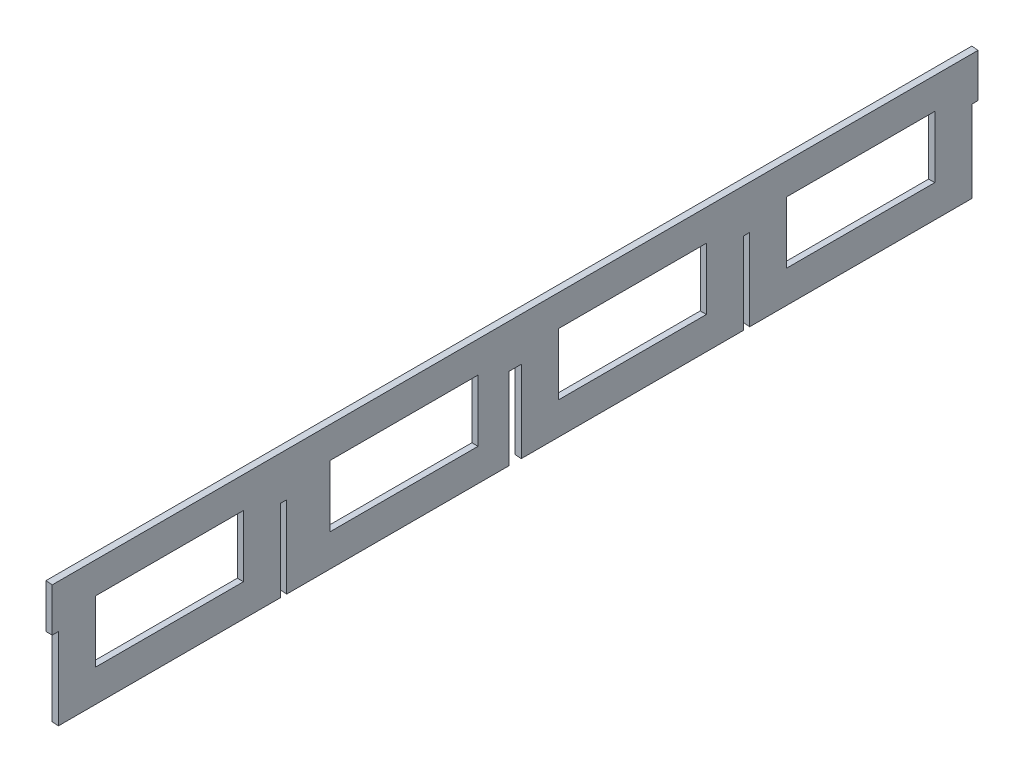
ISO-10303-21;
HEADER;
FILE_DESCRIPTION(('STEP AP214'),'2;1');
FILE_NAME('part.step','',(''),(''),'','','');
FILE_SCHEMA(('AUTOMOTIVE_DESIGN { 1 0 10303 214 1 1 1 1 }'));
ENDSEC;
DATA;
#1=APPLICATION_CONTEXT('core data for automotive mechanical design processes');
#2=APPLICATION_PROTOCOL_DEFINITION('international standard','automotive_design',2000,#1);
#3=PRODUCT_CONTEXT('',#1,'mechanical');
#4=PRODUCT('Part','Part','',(#3));
#5=PRODUCT_RELATED_PRODUCT_CATEGORY('part','',(#4));
#6=PRODUCT_DEFINITION_FORMATION('','',#4);
#7=PRODUCT_DEFINITION_CONTEXT('part definition',#1,'design');
#8=PRODUCT_DEFINITION('design','',#6,#7);
#9=PRODUCT_DEFINITION_SHAPE('','',#8);
#10=(LENGTH_UNIT() NAMED_UNIT(*) SI_UNIT(.MILLI.,.METRE.));
#11=(NAMED_UNIT(*) PLANE_ANGLE_UNIT() SI_UNIT($,.RADIAN.));
#12=(NAMED_UNIT(*) SI_UNIT($,.STERADIAN.) SOLID_ANGLE_UNIT());
#13=UNCERTAINTY_MEASURE_WITH_UNIT(LENGTH_MEASURE(1.E-05),#10,'distance_accuracy_value','');
#14=(GEOMETRIC_REPRESENTATION_CONTEXT(3) GLOBAL_UNCERTAINTY_ASSIGNED_CONTEXT((#13)) GLOBAL_UNIT_ASSIGNED_CONTEXT((#10,
#11,#12)) REPRESENTATION_CONTEXT('',''));
#15=CARTESIAN_POINT('',(0.,0.,0.));
#16=DIRECTION('',(0.,0.,1.));
#17=DIRECTION('',(1.,0.,0.));
#18=AXIS2_PLACEMENT_3D('',#15,#16,#17);
#19=CARTESIAN_POINT('',(185.1025,0.,473.075));
#20=DIRECTION('',(-1.,0.,0.));
#21=DIRECTION('',(0.,0.,1.));
#22=AXIS2_PLACEMENT_3D('',#19,#20,#21);
#23=PLANE('',#22);
#24=DIRECTION('',(0.,1.,0.));
#25=VECTOR('',#24,1.);
#26=CARTESIAN_POINT('',(185.1025,-11.5621735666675,98.4250000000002));
#27=LINE('',#26,#25);
#28=CARTESIAN_POINT('',(185.1025,-11.5621735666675,98.4250000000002));
#29=VERTEX_POINT('',#28);
#30=CARTESIAN_POINT('',(185.1025,20.1878264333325,98.4250000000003));
#31=VERTEX_POINT('',#30);
#32=EDGE_CURVE('E69',#29,#31,#27,.T.);
#33=ORIENTED_EDGE('',*,*,#32,.F.);
#34=DIRECTION('',(0.,0.,1.));
#35=VECTOR('',#34,1.);
#36=CARTESIAN_POINT('',(185.1025,-11.5621735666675,22.2250000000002));
#37=LINE('',#36,#35);
#38=CARTESIAN_POINT('',(185.1025,-11.5621735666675,22.2250000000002));
#39=VERTEX_POINT('',#38);
#40=EDGE_CURVE('E336',#39,#29,#37,.T.);
#41=ORIENTED_EDGE('',*,*,#40,.F.);
#42=DIRECTION('',(0.,-1.,0.));
#43=VECTOR('',#42,1.);
#44=CARTESIAN_POINT('',(185.1025,-11.5621735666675,22.2250000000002));
#45=LINE('',#44,#43);
#46=CARTESIAN_POINT('',(185.1025,20.1878264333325,22.2250000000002));
#47=VERTEX_POINT('',#46);
#48=EDGE_CURVE('E318',#47,#39,#45,.T.);
#49=ORIENTED_EDGE('',*,*,#48,.F.);
#50=DIRECTION('',(0.,0.,-1.));
#51=VECTOR('',#50,1.);
#52=CARTESIAN_POINT('',(185.1025,20.1878264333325,22.2250000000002));
#53=LINE('',#52,#51);
#54=EDGE_CURVE('E329',#31,#47,#53,.T.);
#55=ORIENTED_EDGE('',*,*,#54,.F.);
#56=EDGE_LOOP('',(#33,#41,#49,#55));
#57=FACE_BOUND('',#56,.T.);
#58=DIRECTION('',(0.,1.,0.));
#59=VECTOR('',#58,1.);
#60=CARTESIAN_POINT('',(185.1025,-11.5621735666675,333.375));
#61=LINE('',#60,#59);
#62=CARTESIAN_POINT('',(185.1025,-11.5621735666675,333.375));
#63=VERTEX_POINT('',#62);
#64=CARTESIAN_POINT('',(185.1025,20.1878264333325,333.375));
#65=VERTEX_POINT('',#64);
#66=EDGE_CURVE('E77',#63,#65,#61,.T.);
#67=ORIENTED_EDGE('',*,*,#66,.F.);
#68=DIRECTION('',(0.,0.,1.));
#69=VECTOR('',#68,1.);
#70=CARTESIAN_POINT('',(185.1025,-11.5621735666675,333.375));
#71=LINE('',#70,#69);
#72=CARTESIAN_POINT('',(185.1025,-11.5621735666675,257.175));
#73=VERTEX_POINT('',#72);
#74=EDGE_CURVE('E355',#73,#63,#71,.T.);
#75=ORIENTED_EDGE('',*,*,#74,.F.);
#76=DIRECTION('',(0.,-1.,0.));
#77=VECTOR('',#76,1.);
#78=CARTESIAN_POINT('',(185.1025,-11.5621735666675,257.175));
#79=LINE('',#78,#77);
#80=CARTESIAN_POINT('',(185.1025,20.1878264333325,257.175));
#81=VERTEX_POINT('',#80);
#82=EDGE_CURVE('E369',#81,#73,#79,.T.);
#83=ORIENTED_EDGE('',*,*,#82,.F.);
#84=DIRECTION('',(0.,0.,-1.));
#85=VECTOR('',#84,1.);
#86=CARTESIAN_POINT('',(185.1025,20.1878264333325,333.375));
#87=LINE('',#86,#85);
#88=EDGE_CURVE('E373',#65,#81,#87,.T.);
#89=ORIENTED_EDGE('',*,*,#88,.F.);
#90=EDGE_LOOP('',(#67,#75,#83,#89));
#91=FACE_BOUND('',#90,.T.);
#92=DIRECTION('',(0.,-1.,0.));
#93=VECTOR('',#92,1.);
#94=CARTESIAN_POINT('',(185.1025,-11.5621199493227,139.7));
#95=LINE('',#94,#93);
#96=CARTESIAN_POINT('',(185.1025,20.1878800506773,139.7));
#97=VERTEX_POINT('',#96);
#98=CARTESIAN_POINT('',(185.1025,-11.5621199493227,139.7));
#99=VERTEX_POINT('',#98);
#100=EDGE_CURVE('E365',#97,#99,#95,.T.);
#101=ORIENTED_EDGE('',*,*,#100,.F.);
#102=DIRECTION('',(0.,0.,-1.));
#103=VECTOR('',#102,1.);
#104=CARTESIAN_POINT('',(185.1025,20.1878800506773,215.9));
#105=LINE('',#104,#103);
#106=CARTESIAN_POINT('',(185.1025,20.1878800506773,215.9));
#107=VERTEX_POINT('',#106);
#108=EDGE_CURVE('E383',#107,#97,#105,.T.);
#109=ORIENTED_EDGE('',*,*,#108,.F.);
#110=DIRECTION('',(0.,1.,0.));
#111=VECTOR('',#110,1.);
#112=CARTESIAN_POINT('',(185.1025,-11.5621199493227,215.9));
#113=LINE('',#112,#111);
#114=CARTESIAN_POINT('',(185.1025,-11.5621199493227,215.9));
#115=VERTEX_POINT('',#114);
#116=EDGE_CURVE('E397',#115,#107,#113,.T.);
#117=ORIENTED_EDGE('',*,*,#116,.F.);
#118=DIRECTION('',(0.,0.,1.));
#119=VECTOR('',#118,1.);
#120=CARTESIAN_POINT('',(185.1025,-11.5621199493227,215.9));
#121=LINE('',#120,#119);
#122=EDGE_CURVE('E401',#99,#115,#121,.T.);
#123=ORIENTED_EDGE('',*,*,#122,.F.);
#124=EDGE_LOOP('',(#101,#109,#117,#123));
#125=FACE_BOUND('',#124,.T.);
#126=DIRECTION('',(0.,1.,0.));
#127=VECTOR('',#126,1.);
#128=CARTESIAN_POINT('',(185.1025,-11.5621735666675,454.025));
#129=LINE('',#128,#127);
#130=CARTESIAN_POINT('',(185.1025,-11.5621735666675,454.025));
#131=VERTEX_POINT('',#130);
#132=CARTESIAN_POINT('',(185.1025,20.1878264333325,454.025));
#133=VERTEX_POINT('',#132);
#134=EDGE_CURVE('E393',#131,#133,#129,.T.);
#135=ORIENTED_EDGE('',*,*,#134,.F.);
#136=DIRECTION('',(0.,0.,1.));
#137=VECTOR('',#136,1.);
#138=CARTESIAN_POINT('',(185.1025,-11.5621735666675,454.025));
#139=LINE('',#138,#137);
#140=CARTESIAN_POINT('',(185.1025,-11.5621735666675,377.825));
#141=VERTEX_POINT('',#140);
#142=EDGE_CURVE('E411',#141,#131,#139,.T.);
#143=ORIENTED_EDGE('',*,*,#142,.F.);
#144=DIRECTION('',(0.,-1.,0.));
#145=VECTOR('',#144,1.);
#146=CARTESIAN_POINT('',(185.1025,-11.5621735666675,377.825));
#147=LINE('',#146,#145);
#148=CARTESIAN_POINT('',(185.1025,20.1878264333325,377.825));
#149=VERTEX_POINT('',#148);
#150=EDGE_CURVE('E424',#149,#141,#147,.T.);
#151=ORIENTED_EDGE('',*,*,#150,.F.);
#152=DIRECTION('',(0.,0.,-1.));
#153=VECTOR('',#152,1.);
#154=CARTESIAN_POINT('',(185.1025,20.1878264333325,454.025));
#155=LINE('',#154,#153);
#156=EDGE_CURVE('E428',#133,#149,#155,.T.);
#157=ORIENTED_EDGE('',*,*,#156,.F.);
#158=EDGE_LOOP('',(#135,#143,#151,#157));
#159=FACE_BOUND('',#158,.T.);
#160=DIRECTION('',(0.,0.,1.));
#161=VECTOR('',#160,1.);
#162=CARTESIAN_POINT('',(185.1025,-27.9434873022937,142.974));
#163=LINE('',#162,#161);
#164=CARTESIAN_POINT('',(185.102500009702,-27.9434873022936,4.81200000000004));
#165=VERTEX_POINT('',#164);
#166=CARTESIAN_POINT('',(185.102500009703,-27.9434873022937,117.475));
#167=VERTEX_POINT('',#166);
#168=EDGE_CURVE('E806',#165,#167,#163,.T.);
#169=ORIENTED_EDGE('',*,*,#168,.T.);
#170=DIRECTION('',(-2.32122323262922E-10,1.,0.));
#171=VECTOR('',#170,1.);
#172=CARTESIAN_POINT('',(185.102500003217,4.29664223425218E-08,117.475));
#173=LINE('',#172,#171);
#174=CARTESIAN_POINT('',(185.1025,13.8593727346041,117.475));
#175=VERTEX_POINT('',#174);
#176=EDGE_CURVE('E434',#167,#175,#173,.T.);
#177=ORIENTED_EDGE('',*,*,#176,.T.);
#178=DIRECTION('',(0.,0.,1.));
#179=VECTOR('',#178,1.);
#180=CARTESIAN_POINT('',(185.1025,13.8593727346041,117.475));
#181=LINE('',#180,#179);
#182=CARTESIAN_POINT('',(185.1025,13.8593727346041,120.65));
#183=VERTEX_POINT('',#182);
#184=EDGE_CURVE('E474',#175,#183,#181,.T.);
#185=ORIENTED_EDGE('',*,*,#184,.T.);
#186=DIRECTION('',(-2.32122323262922E-10,1.,0.));
#187=VECTOR('',#186,1.);
#188=CARTESIAN_POINT('',(185.102500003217,4.29664223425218E-08,120.65));
#189=LINE('',#188,#187);
#190=CARTESIAN_POINT('',(185.102500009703,-27.9434873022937,120.65));
#191=VERTEX_POINT('',#190);
#192=EDGE_CURVE('E347',#191,#183,#189,.T.);
#193=ORIENTED_EDGE('',*,*,#192,.F.);
#194=CARTESIAN_POINT('',(185.102500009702,-27.9434873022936,156.958));
#195=VERTEX_POINT('',#194);
#196=EDGE_CURVE('E780',#191,#195,#163,.T.);
#197=ORIENTED_EDGE('',*,*,#196,.T.);
#198=DIRECTION('',(0.,0.,1.));
#199=VECTOR('',#198,1.);
#200=CARTESIAN_POINT('',(185.102500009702,-27.9434873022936,-0.0499999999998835));
#201=LINE('',#200,#199);
#202=CARTESIAN_POINT('',(185.102500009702,-27.9434873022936,161.958));
#203=VERTEX_POINT('',#202);
#204=EDGE_CURVE('E698',#195,#203,#201,.T.);
#205=ORIENTED_EDGE('',*,*,#204,.T.);
#206=CARTESIAN_POINT('',(185.102500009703,-27.9434873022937,234.95));
#207=VERTEX_POINT('',#206);
#208=EDGE_CURVE('E726',#203,#207,#163,.T.);
#209=ORIENTED_EDGE('',*,*,#208,.T.);
#210=DIRECTION('',(2.32122323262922E-10,-1.,0.));
#211=VECTOR('',#210,1.);
#212=CARTESIAN_POINT('',(185.102500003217,4.29664223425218E-08,234.95));
#213=LINE('',#212,#211);
#214=CARTESIAN_POINT('',(185.1025,13.8593727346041,234.95));
#215=VERTEX_POINT('',#214);
#216=EDGE_CURVE('E484',#215,#207,#213,.T.);
#217=ORIENTED_EDGE('',*,*,#216,.F.);
#218=DIRECTION('',(0.,0.,1.));
#219=VECTOR('',#218,1.);
#220=CARTESIAN_POINT('',(185.1025,13.8593727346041,234.95));
#221=LINE('',#220,#219);
#222=CARTESIAN_POINT('',(185.1025,13.8593727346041,241.3));
#223=VERTEX_POINT('',#222);
#224=EDGE_CURVE('E478',#215,#223,#221,.T.);
#225=ORIENTED_EDGE('',*,*,#224,.T.);
#226=DIRECTION('',(2.32122323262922E-10,-1.,0.));
#227=VECTOR('',#226,1.);
#228=CARTESIAN_POINT('',(185.102500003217,4.29664223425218E-08,241.3));
#229=LINE('',#228,#227);
#230=CARTESIAN_POINT('',(185.102500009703,-27.9434873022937,241.3));
#231=VERTEX_POINT('',#230);
#232=EDGE_CURVE('E488',#223,#231,#229,.T.);
#233=ORIENTED_EDGE('',*,*,#232,.T.);
#234=CARTESIAN_POINT('',(185.102500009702,-27.9434873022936,300.12));
#235=VERTEX_POINT('',#234);
#236=EDGE_CURVE('E732',#231,#235,#163,.T.);
#237=ORIENTED_EDGE('',*,*,#236,.T.);
#238=DIRECTION('',(0.,0.,1.));
#239=VECTOR('',#238,1.);
#240=CARTESIAN_POINT('',(185.102500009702,-27.9434873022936,300.12));
#241=LINE('',#240,#239);
#242=CARTESIAN_POINT('',(185.102500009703,-27.9434873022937,355.6));
#243=VERTEX_POINT('',#242);
#244=EDGE_CURVE('E1021',#235,#243,#241,.T.);
#245=ORIENTED_EDGE('',*,*,#244,.T.);
#246=DIRECTION('',(-2.32122323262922E-10,1.,0.));
#247=VECTOR('',#246,1.);
#248=CARTESIAN_POINT('',(185.102500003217,4.29664223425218E-08,355.6));
#249=LINE('',#248,#247);
#250=CARTESIAN_POINT('',(185.1025,13.8593727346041,355.6));
#251=VERTEX_POINT('',#250);
#252=EDGE_CURVE('E517',#243,#251,#249,.T.);
#253=ORIENTED_EDGE('',*,*,#252,.T.);
#254=DIRECTION('',(0.,0.,1.));
#255=VECTOR('',#254,1.);
#256=CARTESIAN_POINT('',(185.1025,13.8593727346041,355.6));
#257=LINE('',#256,#255);
#258=CARTESIAN_POINT('',(185.1025,13.8593727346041,358.775));
#259=VERTEX_POINT('',#258);
#260=EDGE_CURVE('E557',#251,#259,#257,.T.);
#261=ORIENTED_EDGE('',*,*,#260,.T.);
#262=DIRECTION('',(-2.32122323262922E-10,1.,0.));
#263=VECTOR('',#262,1.);
#264=CARTESIAN_POINT('',(185.102500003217,4.29664223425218E-08,358.775));
#265=LINE('',#264,#263);
#266=CARTESIAN_POINT('',(185.102500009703,-27.9434873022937,358.775));
#267=VERTEX_POINT('',#266);
#268=EDGE_CURVE('E503',#267,#259,#265,.T.);
#269=ORIENTED_EDGE('',*,*,#268,.F.);
#270=CARTESIAN_POINT('',(185.102500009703,-27.9434873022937,473.075));
#271=VERTEX_POINT('',#270);
#272=EDGE_CURVE('E772',#267,#271,#241,.T.);
#273=ORIENTED_EDGE('',*,*,#272,.T.);
#274=DIRECTION('',(0.,-1.,0.));
#275=VECTOR('',#274,1.);
#276=CARTESIAN_POINT('',(185.1025,0.,473.075));
#277=LINE('',#276,#275);
#278=CARTESIAN_POINT('',(185.1025,13.8593727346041,473.075));
#279=VERTEX_POINT('',#278);
#280=EDGE_CURVE('E713',#279,#271,#277,.T.);
#281=ORIENTED_EDGE('',*,*,#280,.F.);
#282=DIRECTION('',(0.,0.,1.));
#283=VECTOR('',#282,1.);
#284=CARTESIAN_POINT('',(185.1025,13.8593727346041,473.075));
#285=LINE('',#284,#283);
#286=CARTESIAN_POINT('',(185.1025,13.8593727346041,476.25));
#287=VERTEX_POINT('',#286);
#288=EDGE_CURVE('E752',#279,#287,#285,.T.);
#289=ORIENTED_EDGE('',*,*,#288,.T.);
#290=DIRECTION('',(0.,-1.,0.));
#291=VECTOR('',#290,1.);
#292=CARTESIAN_POINT('',(185.1025,0.,476.25));
#293=LINE('',#292,#291);
#294=CARTESIAN_POINT('',(185.102499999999,36.5692474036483,476.25));
#295=VERTEX_POINT('',#294);
#296=EDGE_CURVE('E781',#295,#287,#293,.T.);
#297=ORIENTED_EDGE('',*,*,#296,.F.);
#298=DIRECTION('',(0.,0.,-1.));
#299=VECTOR('',#298,1.);
#300=CARTESIAN_POINT('',(185.1025,36.5692474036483,3.175));
#301=LINE('',#300,#299);
#302=CARTESIAN_POINT('',(185.1025,36.5692474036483,0.));
#303=VERTEX_POINT('',#302);
#304=EDGE_CURVE('E801',#295,#303,#301,.T.);
#305=ORIENTED_EDGE('',*,*,#304,.T.);
#306=DIRECTION('',(0.,1.,0.));
#307=VECTOR('',#306,1.);
#308=CARTESIAN_POINT('',(185.1025,7.78722275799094,0.));
#309=LINE('',#308,#307);
#310=CARTESIAN_POINT('',(185.1025,13.8593727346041,0.));
#311=VERTEX_POINT('',#310);
#312=EDGE_CURVE('E745',#311,#303,#309,.T.);
#313=ORIENTED_EDGE('',*,*,#312,.F.);
#314=DIRECTION('',(0.,0.,-1.));
#315=VECTOR('',#314,1.);
#316=CARTESIAN_POINT('',(185.1025,13.8593727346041,3.175));
#317=LINE('',#316,#315);
#318=CARTESIAN_POINT('',(185.1025,13.8593727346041,3.175));
#319=VERTEX_POINT('',#318);
#320=EDGE_CURVE('E743',#319,#311,#317,.T.);
#321=ORIENTED_EDGE('',*,*,#320,.F.);
#322=DIRECTION('',(0.,1.,0.));
#323=VECTOR('',#322,1.);
#324=CARTESIAN_POINT('',(185.1025,25.3981079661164,3.175));
#325=LINE('',#324,#323);
#326=CARTESIAN_POINT('',(185.102500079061,-27.9437017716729,3.17500000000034));
#327=VERTEX_POINT('',#326);
#328=EDGE_CURVE('E573',#327,#319,#325,.T.);
#329=ORIENTED_EDGE('',*,*,#328,.F.);
#330=EDGE_CURVE('E570',#327,#165,#201,.T.);
#331=ORIENTED_EDGE('',*,*,#330,.T.);
#332=EDGE_LOOP('',(#169,#177,#185,#193,#197,#205,#209,#217,#225,#233,#237,#245,#253,#261,#269,
#273,#281,#289,#297,#305,#313,#321,#329,#331));
#333=FACE_BOUND('',#332,.T.);
#334=ADVANCED_FACE('F53',(#57,#91,#125,#159,#333),#23,.T.);
#335=CARTESIAN_POINT('',(188.2775,7.78722275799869,3.175));
#336=DIRECTION('',(-1.,0.,0.));
#337=DIRECTION('',(0.,-1.,0.));
#338=AXIS2_PLACEMENT_3D('',#335,#336,#337);
#339=PLANE('',#338);
#340=DIRECTION('',(0.,0.,1.));
#341=VECTOR('',#340,1.);
#342=CARTESIAN_POINT('',(188.277500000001,-11.5621735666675,3.175));
#343=LINE('',#342,#341);
#344=CARTESIAN_POINT('',(188.2775,-11.5621735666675,22.2250000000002));
#345=VERTEX_POINT('',#344);
#346=CARTESIAN_POINT('',(188.277500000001,-11.5621735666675,98.4250000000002));
#347=VERTEX_POINT('',#346);
#348=EDGE_CURVE('E62',#345,#347,#343,.T.);
#349=ORIENTED_EDGE('',*,*,#348,.T.);
#350=DIRECTION('',(0.,1.,0.));
#351=VECTOR('',#350,1.);
#352=CARTESIAN_POINT('',(188.2775,7.78722275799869,98.4250000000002));
#353=LINE('',#352,#351);
#354=CARTESIAN_POINT('',(188.2775,20.1878264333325,98.4250000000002));
#355=VERTEX_POINT('',#354);
#356=EDGE_CURVE('E11',#347,#355,#353,.T.);
#357=ORIENTED_EDGE('',*,*,#356,.T.);
#358=DIRECTION('',(0.,0.,-1.));
#359=VECTOR('',#358,1.);
#360=CARTESIAN_POINT('',(188.2775,20.1878264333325,3.175));
#361=LINE('',#360,#359);
#362=CARTESIAN_POINT('',(188.2775,20.1878264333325,22.2250000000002));
#363=VERTEX_POINT('',#362);
#364=EDGE_CURVE('E915',#355,#363,#361,.T.);
#365=ORIENTED_EDGE('',*,*,#364,.T.);
#366=DIRECTION('',(0.,-1.,0.));
#367=VECTOR('',#366,1.);
#368=CARTESIAN_POINT('',(188.2775,7.78722275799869,22.2250000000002));
#369=LINE('',#368,#367);
#370=EDGE_CURVE('E321',#363,#345,#369,.T.);
#371=ORIENTED_EDGE('',*,*,#370,.T.);
#372=EDGE_LOOP('',(#349,#357,#365,#371));
#373=FACE_BOUND('',#372,.T.);
#374=DIRECTION('',(0.,0.,1.));
#375=VECTOR('',#374,1.);
#376=CARTESIAN_POINT('',(188.277500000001,-11.5621735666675,3.175));
#377=LINE('',#376,#375);
#378=CARTESIAN_POINT('',(188.2775,-11.5621735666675,257.175));
#379=VERTEX_POINT('',#378);
#380=CARTESIAN_POINT('',(188.277500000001,-11.5621735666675,333.375));
#381=VERTEX_POINT('',#380);
#382=EDGE_CURVE('E907',#379,#381,#377,.T.);
#383=ORIENTED_EDGE('',*,*,#382,.T.);
#384=DIRECTION('',(0.,1.,0.));
#385=VECTOR('',#384,1.);
#386=CARTESIAN_POINT('',(188.2775,7.78722275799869,333.375));
#387=LINE('',#386,#385);
#388=CARTESIAN_POINT('',(188.2775,20.1878264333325,333.375));
#389=VERTEX_POINT('',#388);
#390=EDGE_CURVE('E911',#381,#389,#387,.T.);
#391=ORIENTED_EDGE('',*,*,#390,.T.);
#392=DIRECTION('',(0.,0.,-1.));
#393=VECTOR('',#392,1.);
#394=CARTESIAN_POINT('',(188.2775,20.1878264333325,3.175));
#395=LINE('',#394,#393);
#396=CARTESIAN_POINT('',(188.2775,20.1878264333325,257.175));
#397=VERTEX_POINT('',#396);
#398=EDGE_CURVE('E899',#389,#397,#395,.T.);
#399=ORIENTED_EDGE('',*,*,#398,.T.);
#400=DIRECTION('',(0.,-1.,0.));
#401=VECTOR('',#400,1.);
#402=CARTESIAN_POINT('',(188.2775,7.78722275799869,257.175));
#403=LINE('',#402,#401);
#404=EDGE_CURVE('E903',#397,#379,#403,.T.);
#405=ORIENTED_EDGE('',*,*,#404,.T.);
#406=EDGE_LOOP('',(#383,#391,#399,#405));
#407=FACE_BOUND('',#406,.T.);
#408=DIRECTION('',(0.,0.,-1.));
#409=VECTOR('',#408,1.);
#410=CARTESIAN_POINT('',(188.2775,20.1878800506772,3.175));
#411=LINE('',#410,#409);
#412=CARTESIAN_POINT('',(188.2775,20.1878800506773,215.9));
#413=VERTEX_POINT('',#412);
#414=CARTESIAN_POINT('',(188.2775,20.1878800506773,139.7));
#415=VERTEX_POINT('',#414);
#416=EDGE_CURVE('E891',#413,#415,#411,.T.);
#417=ORIENTED_EDGE('',*,*,#416,.T.);
#418=DIRECTION('',(0.,-1.,0.));
#419=VECTOR('',#418,1.);
#420=CARTESIAN_POINT('',(188.2775,7.78722275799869,139.7));
#421=LINE('',#420,#419);
#422=CARTESIAN_POINT('',(188.277500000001,-11.5621199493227,139.7));
#423=VERTEX_POINT('',#422);
#424=EDGE_CURVE('E895',#415,#423,#421,.T.);
#425=ORIENTED_EDGE('',*,*,#424,.T.);
#426=DIRECTION('',(0.,0.,1.));
#427=VECTOR('',#426,1.);
#428=CARTESIAN_POINT('',(188.277500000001,-11.5621199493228,3.175));
#429=LINE('',#428,#427);
#430=CARTESIAN_POINT('',(188.277500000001,-11.5621199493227,215.9));
#431=VERTEX_POINT('',#430);
#432=EDGE_CURVE('E883',#423,#431,#429,.T.);
#433=ORIENTED_EDGE('',*,*,#432,.T.);
#434=DIRECTION('',(0.,1.,0.));
#435=VECTOR('',#434,1.);
#436=CARTESIAN_POINT('',(188.2775,7.78722275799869,215.9));
#437=LINE('',#436,#435);
#438=EDGE_CURVE('E887',#431,#413,#437,.T.);
#439=ORIENTED_EDGE('',*,*,#438,.T.);
#440=EDGE_LOOP('',(#417,#425,#433,#439));
#441=FACE_BOUND('',#440,.T.);
#442=DIRECTION('',(0.,0.,1.));
#443=VECTOR('',#442,1.);
#444=CARTESIAN_POINT('',(188.277500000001,-11.5621735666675,3.175));
#445=LINE('',#444,#443);
#446=CARTESIAN_POINT('',(188.2775,-11.5621735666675,377.825));
#447=VERTEX_POINT('',#446);
#448=CARTESIAN_POINT('',(188.277500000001,-11.5621735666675,454.025));
#449=VERTEX_POINT('',#448);
#450=EDGE_CURVE('E875',#447,#449,#445,.T.);
#451=ORIENTED_EDGE('',*,*,#450,.T.);
#452=DIRECTION('',(0.,1.,0.));
#453=VECTOR('',#452,1.);
#454=CARTESIAN_POINT('',(188.2775,7.78722275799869,454.025));
#455=LINE('',#454,#453);
#456=CARTESIAN_POINT('',(188.2775,20.1878264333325,454.025));
#457=VERTEX_POINT('',#456);
#458=EDGE_CURVE('E879',#449,#457,#455,.T.);
#459=ORIENTED_EDGE('',*,*,#458,.T.);
#460=DIRECTION('',(0.,0.,-1.));
#461=VECTOR('',#460,1.);
#462=CARTESIAN_POINT('',(188.2775,20.1878264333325,3.175));
#463=LINE('',#462,#461);
#464=CARTESIAN_POINT('',(188.2775,20.1878264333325,377.825));
#465=VERTEX_POINT('',#464);
#466=EDGE_CURVE('E712',#457,#465,#463,.T.);
#467=ORIENTED_EDGE('',*,*,#466,.T.);
#468=DIRECTION('',(0.,-1.,0.));
#469=VECTOR('',#468,1.);
#470=CARTESIAN_POINT('',(188.2775,7.78722275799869,377.825));
#471=LINE('',#470,#469);
#472=EDGE_CURVE('E871',#465,#447,#471,.T.);
#473=ORIENTED_EDGE('',*,*,#472,.T.);
#474=EDGE_LOOP('',(#451,#459,#467,#473));
#475=FACE_BOUND('',#474,.T.);
#476=DIRECTION('',(-9.22888568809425E-11,1.,0.));
#477=VECTOR('',#476,1.);
#478=CARTESIAN_POINT('',(188.277500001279,1.73759152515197E-08,117.475));
#479=LINE('',#478,#477);
#480=CARTESIAN_POINT('',(188.27750000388,-28.1856272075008,117.475));
#481=VERTEX_POINT('',#480);
#482=CARTESIAN_POINT('',(188.2775,13.8593727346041,117.475));
#483=VERTEX_POINT('',#482);
#484=EDGE_CURVE('E444',#481,#483,#479,.T.);
#485=ORIENTED_EDGE('',*,*,#484,.F.);
#486=DIRECTION('',(0.,0.,1.));
#487=VECTOR('',#486,1.);
#488=CARTESIAN_POINT('',(188.27750000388,-28.1856272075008,142.974));
#489=LINE('',#488,#487);
#490=CARTESIAN_POINT('',(188.27750000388,-28.1856272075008,4.81200000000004));
#491=VERTEX_POINT('',#490);
#492=EDGE_CURVE('E850',#491,#481,#489,.T.);
#493=ORIENTED_EDGE('',*,*,#492,.F.);
#494=DIRECTION('',(0.,0.,1.));
#495=VECTOR('',#494,1.);
#496=CARTESIAN_POINT('',(188.27750000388,-28.1856272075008,-0.0499999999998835));
#497=LINE('',#496,#495);
#498=CARTESIAN_POINT('',(188.277500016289,-28.1856708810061,3.17500000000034));
#499=VERTEX_POINT('',#498);
#500=EDGE_CURVE('E679',#499,#491,#497,.T.);
#501=ORIENTED_EDGE('',*,*,#500,.F.);
#502=DIRECTION('',(0.,1.,0.));
#503=VECTOR('',#502,1.);
#504=CARTESIAN_POINT('',(188.277499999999,25.3981079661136,3.175));
#505=LINE('',#504,#503);
#506=CARTESIAN_POINT('',(188.2775,13.8593727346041,3.175));
#507=VERTEX_POINT('',#506);
#508=EDGE_CURVE('E566',#499,#507,#505,.T.);
#509=ORIENTED_EDGE('',*,*,#508,.T.);
#510=DIRECTION('',(0.,0.,-1.));
#511=VECTOR('',#510,1.);
#512=CARTESIAN_POINT('',(188.2775,13.8593727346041,3.175));
#513=LINE('',#512,#511);
#514=CARTESIAN_POINT('',(188.2775,13.8593727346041,0.));
#515=VERTEX_POINT('',#514);
#516=EDGE_CURVE('E738',#507,#515,#513,.T.);
#517=ORIENTED_EDGE('',*,*,#516,.T.);
#518=DIRECTION('',(0.,1.,0.));
#519=VECTOR('',#518,1.);
#520=CARTESIAN_POINT('',(188.2775,7.78722275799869,0.));
#521=LINE('',#520,#519);
#522=CARTESIAN_POINT('',(188.277499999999,36.2413167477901,0.));
#523=VERTEX_POINT('',#522);
#524=EDGE_CURVE('E742',#515,#523,#521,.T.);
#525=ORIENTED_EDGE('',*,*,#524,.T.);
#526=DIRECTION('',(0.,0.,1.));
#527=VECTOR('',#526,1.);
#528=CARTESIAN_POINT('',(188.277499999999,36.2413167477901,-22.9307442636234));
#529=LINE('',#528,#527);
#530=CARTESIAN_POINT('',(188.277499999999,36.2413167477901,476.25));
#531=VERTEX_POINT('',#530);
#532=EDGE_CURVE('E741',#523,#531,#529,.T.);
#533=ORIENTED_EDGE('',*,*,#532,.T.);
#534=DIRECTION('',(0.,-1.,0.));
#535=VECTOR('',#534,1.);
#536=CARTESIAN_POINT('',(188.277500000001,7.93834141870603E-12,476.25));
#537=LINE('',#536,#535);
#538=CARTESIAN_POINT('',(188.2775,13.8593727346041,476.25));
#539=VERTEX_POINT('',#538);
#540=EDGE_CURVE('E736',#531,#539,#537,.T.);
#541=ORIENTED_EDGE('',*,*,#540,.T.);
#542=DIRECTION('',(0.,0.,1.));
#543=VECTOR('',#542,1.);
#544=CARTESIAN_POINT('',(188.2775,13.8593727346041,473.075));
#545=LINE('',#544,#543);
#546=CARTESIAN_POINT('',(188.2775,13.8593727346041,473.075));
#547=VERTEX_POINT('',#546);
#548=EDGE_CURVE('E577',#547,#539,#545,.T.);
#549=ORIENTED_EDGE('',*,*,#548,.F.);
#550=DIRECTION('',(0.,-1.,0.));
#551=VECTOR('',#550,1.);
#552=CARTESIAN_POINT('',(188.277500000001,7.93834141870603E-12,473.075));
#553=LINE('',#552,#551);
#554=CARTESIAN_POINT('',(188.27750000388,-28.1856272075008,473.075));
#555=VERTEX_POINT('',#554);
#556=EDGE_CURVE('E569',#547,#555,#553,.T.);
#557=ORIENTED_EDGE('',*,*,#556,.T.);
#558=DIRECTION('',(0.,0.,1.));
#559=VECTOR('',#558,1.);
#560=CARTESIAN_POINT('',(188.27750000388,-28.1856272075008,300.12));
#561=LINE('',#560,#559);
#562=CARTESIAN_POINT('',(188.27750000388,-28.1856272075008,358.775));
#563=VERTEX_POINT('',#562);
#564=EDGE_CURVE('E724',#563,#555,#561,.T.);
#565=ORIENTED_EDGE('',*,*,#564,.F.);
#566=DIRECTION('',(-9.22888568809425E-11,1.,0.));
#567=VECTOR('',#566,1.);
#568=CARTESIAN_POINT('',(188.277500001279,1.73759152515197E-08,358.775));
#569=LINE('',#568,#567);
#570=CARTESIAN_POINT('',(188.2775,13.8593727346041,358.775));
#571=VERTEX_POINT('',#570);
#572=EDGE_CURVE('E547',#563,#571,#569,.T.);
#573=ORIENTED_EDGE('',*,*,#572,.T.);
#574=DIRECTION('',(0.,0.,1.));
#575=VECTOR('',#574,1.);
#576=CARTESIAN_POINT('',(188.2775,13.8593727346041,355.6));
#577=LINE('',#576,#575);
#578=CARTESIAN_POINT('',(188.2775,13.8593727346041,355.6));
#579=VERTEX_POINT('',#578);
#580=EDGE_CURVE('E537',#579,#571,#577,.T.);
#581=ORIENTED_EDGE('',*,*,#580,.F.);
#582=DIRECTION('',(-9.22888568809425E-11,1.,0.));
#583=VECTOR('',#582,1.);
#584=CARTESIAN_POINT('',(188.277500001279,1.73759152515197E-08,355.6));
#585=LINE('',#584,#583);
#586=CARTESIAN_POINT('',(188.27750000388,-28.1856272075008,355.6));
#587=VERTEX_POINT('',#586);
#588=EDGE_CURVE('E527',#587,#579,#585,.T.);
#589=ORIENTED_EDGE('',*,*,#588,.F.);
#590=CARTESIAN_POINT('',(188.27750000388,-28.1856272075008,300.12));
#591=VERTEX_POINT('',#590);
#592=EDGE_CURVE('E819',#591,#587,#561,.T.);
#593=ORIENTED_EDGE('',*,*,#592,.F.);
#594=CARTESIAN_POINT('',(188.27750000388,-28.1856272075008,241.3));
#595=VERTEX_POINT('',#594);
#596=EDGE_CURVE('E841',#595,#591,#489,.T.);
#597=ORIENTED_EDGE('',*,*,#596,.F.);
#598=DIRECTION('',(-9.22888568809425E-11,1.,0.));
#599=VECTOR('',#598,1.);
#600=CARTESIAN_POINT('',(188.277500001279,1.73759152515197E-08,241.3));
#601=LINE('',#600,#599);
#602=CARTESIAN_POINT('',(188.2775,13.8593727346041,241.3));
#603=VERTEX_POINT('',#602);
#604=EDGE_CURVE('E496',#595,#603,#601,.T.);
#605=ORIENTED_EDGE('',*,*,#604,.T.);
#606=DIRECTION('',(0.,0.,1.));
#607=VECTOR('',#606,1.);
#608=CARTESIAN_POINT('',(188.2775,13.8593727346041,234.95));
#609=LINE('',#608,#607);
#610=CARTESIAN_POINT('',(188.2775,13.8593727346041,234.95));
#611=VERTEX_POINT('',#610);
#612=EDGE_CURVE('E481',#611,#603,#609,.T.);
#613=ORIENTED_EDGE('',*,*,#612,.F.);
#614=DIRECTION('',(-9.22888568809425E-11,1.,0.));
#615=VECTOR('',#614,1.);
#616=CARTESIAN_POINT('',(188.277500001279,1.73759152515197E-08,234.95));
#617=LINE('',#616,#615);
#618=CARTESIAN_POINT('',(188.27750000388,-28.1856272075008,234.95));
#619=VERTEX_POINT('',#618);
#620=EDGE_CURVE('E510',#619,#611,#617,.T.);
#621=ORIENTED_EDGE('',*,*,#620,.F.);
#622=CARTESIAN_POINT('',(188.27750000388,-28.1856272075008,161.958));
#623=VERTEX_POINT('',#622);
#624=EDGE_CURVE('E784',#623,#619,#489,.T.);
#625=ORIENTED_EDGE('',*,*,#624,.F.);
#626=CARTESIAN_POINT('',(188.27750000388,-28.1856272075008,156.958));
#627=VERTEX_POINT('',#626);
#628=EDGE_CURVE('E699',#627,#623,#497,.T.);
#629=ORIENTED_EDGE('',*,*,#628,.F.);
#630=CARTESIAN_POINT('',(188.27750000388,-28.1856272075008,120.65));
#631=VERTEX_POINT('',#630);
#632=EDGE_CURVE('E561',#631,#627,#489,.T.);
#633=ORIENTED_EDGE('',*,*,#632,.F.);
#634=DIRECTION('',(-9.22888568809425E-11,1.,0.));
#635=VECTOR('',#634,1.);
#636=CARTESIAN_POINT('',(188.277500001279,1.73759152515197E-08,120.65));
#637=LINE('',#636,#635);
#638=CARTESIAN_POINT('',(188.2775,13.8593727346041,120.65));
#639=VERTEX_POINT('',#638);
#640=EDGE_CURVE('E464',#631,#639,#637,.T.);
#641=ORIENTED_EDGE('',*,*,#640,.T.);
#642=DIRECTION('',(0.,0.,1.));
#643=VECTOR('',#642,1.);
#644=CARTESIAN_POINT('',(188.2775,13.8593727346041,117.475));
#645=LINE('',#644,#643);
#646=EDGE_CURVE('E454',#483,#639,#645,.T.);
#647=ORIENTED_EDGE('',*,*,#646,.F.);
#648=EDGE_LOOP('',(#485,#493,#501,#509,#517,#525,#533,#541,#549,#557,#565,#573,#581,#589,#593,
#597,#605,#613,#621,#625,#629,#633,#641,#647));
#649=FACE_BOUND('',#648,.T.);
#650=ADVANCED_FACE('F626',(#373,#407,#441,#475,#649),#339,.F.);
#651=CARTESIAN_POINT('',(185.102500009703,-27.9434873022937,142.974));
#652=CARTESIAN_POINT('',(185.246842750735,-27.9543228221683,142.974));
#653=CARTESIAN_POINT('',(186.305257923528,-28.033948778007,142.974));
#654=CARTESIAN_POINT('',(187.363578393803,-28.1148418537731,142.974));
#655=CARTESIAN_POINT('',(188.27750000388,-28.1856272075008,142.974));
#656=B_SPLINE_CURVE_WITH_KNOTS('',3,(#651,#652,#653,#654,#655),.UNSPECIFIED.,.F.,.F.,(4,1,4),
(0.,0.136374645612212,1.),.UNSPECIFIED.);
#657=DIRECTION('',(0.,0.,1.));
#658=VECTOR('',#657,1.);
#659=SURFACE_OF_LINEAR_EXTRUSION('',#656,#658);
#660=ORIENTED_EDGE('',*,*,#492,.T.);
#661=CARTESIAN_POINT('',(185.102500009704,-27.9434873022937,117.475));
#662=CARTESIAN_POINT('',(186.160927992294,-28.0229413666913,117.475));
#663=CARTESIAN_POINT('',(187.219261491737,-28.1036641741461,117.475));
#664=CARTESIAN_POINT('',(188.27750000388,-28.1856272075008,117.475));
#665=B_SPLINE_CURVE_WITH_KNOTS('',3,(#661,#662,#663,#664),.UNSPECIFIED.,.F.,.F.,(4,4),
(0.682305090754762,0.685177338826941),.UNSPECIFIED.);
#666=EDGE_CURVE('E438',#167,#481,#665,.T.);
#667=ORIENTED_EDGE('',*,*,#666,.F.);
#668=ORIENTED_EDGE('',*,*,#168,.F.);
#669=CARTESIAN_POINT('',(185.102500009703,-27.9434873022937,4.81200000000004));
#670=CARTESIAN_POINT('',(185.246842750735,-27.9543228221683,4.81200000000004));
#671=CARTESIAN_POINT('',(186.305257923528,-28.033948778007,4.81200000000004));
#672=CARTESIAN_POINT('',(187.363578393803,-28.1148418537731,4.81200000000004));
#673=CARTESIAN_POINT('',(188.27750000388,-28.1856272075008,4.81200000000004));
#674=B_SPLINE_CURVE_WITH_KNOTS('',3,(#669,#670,#671,#672,#673),.UNSPECIFIED.,.F.,.F.,(4,1,4),
(0.,0.136374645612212,1.),.UNSPECIFIED.);
#675=EDGE_CURVE('E685',#491,#165,#674,.F.);
#676=ORIENTED_EDGE('',*,*,#675,.F.);
#677=EDGE_LOOP('',(#660,#667,#668,#676));
#678=FACE_BOUND('',#677,.T.);
#679=ADVANCED_FACE('F632',(#678),#659,.T.);
#680=ORIENTED_EDGE('',*,*,#624,.T.);
#681=CARTESIAN_POINT('',(84.544788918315,-1367.41853252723,234.95));
#682=DIRECTION('',(0.,0.,1.));
#683=DIRECTION('',(1.,0.,0.));
#684=AXIS2_PLACEMENT_3D('',#681,#682,#683);
#685=CIRCLE('',#684,1343.24430020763);
#686=EDGE_CURVE('E493',#619,#207,#685,.T.);
#687=ORIENTED_EDGE('',*,*,#686,.T.);
#688=ORIENTED_EDGE('',*,*,#208,.F.);
#689=CARTESIAN_POINT('',(185.102500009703,-27.9434873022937,161.958));
#690=CARTESIAN_POINT('',(185.246842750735,-27.9543228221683,161.958));
#691=CARTESIAN_POINT('',(186.305257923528,-28.033948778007,161.958));
#692=CARTESIAN_POINT('',(187.363578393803,-28.1148418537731,161.958));
#693=CARTESIAN_POINT('',(188.27750000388,-28.1856272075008,161.958));
#694=B_SPLINE_CURVE_WITH_KNOTS('',3,(#689,#690,#691,#692,#693),.UNSPECIFIED.,.F.,.F.,(4,1,4),
(0.,0.136374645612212,1.),.UNSPECIFIED.);
#695=EDGE_CURVE('E701',#623,#203,#694,.F.);
#696=ORIENTED_EDGE('',*,*,#695,.F.);
#697=EDGE_LOOP('',(#680,#687,#688,#696));
#698=FACE_BOUND('',#697,.T.);
#699=ADVANCED_FACE('F652',(#698),#659,.T.);
#700=CARTESIAN_POINT('',(533.4,-74.964481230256,476.25));
#701=CARTESIAN_POINT('',(533.393468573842,-74.3592932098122,476.25));
#702=CARTESIAN_POINT('',(531.326375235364,-72.9726299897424,476.25));
#703=CARTESIAN_POINT('',(527.400147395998,-71.2980390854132,476.25));
#704=CARTESIAN_POINT('',(520.602221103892,-67.7648945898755,476.25));
#705=CARTESIAN_POINT('',(511.347792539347,-63.3267299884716,476.25));
#706=CARTESIAN_POINT('',(499.502755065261,-57.6778186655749,476.25));
#707=CARTESIAN_POINT('',(485.246764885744,-51.1384096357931,476.25));
#708=CARTESIAN_POINT('',(468.676978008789,-43.8036364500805,476.25));
#709=CARTESIAN_POINT('',(449.947936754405,-35.8757202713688,476.25));
#710=CARTESIAN_POINT('',(429.230598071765,-27.5332286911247,476.25));
#711=CARTESIAN_POINT('',(406.718257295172,-18.9792879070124,476.25));
#712=CARTESIAN_POINT('',(382.640885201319,-10.382344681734,476.25));
#713=CARTESIAN_POINT('',(357.234331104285,-1.94698223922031,476.25));
#714=CARTESIAN_POINT('',(330.760171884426,6.14483374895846,476.25));
#715=CARTESIAN_POINT('',(303.50010629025,13.7381782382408,476.25));
#716=CARTESIAN_POINT('',(275.749595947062,20.6681404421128,476.25));
#717=CARTESIAN_POINT('',(247.797497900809,26.795319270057,476.25));
#718=CARTESIAN_POINT('',(219.77579834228,32.1343026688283,476.25));
#719=CARTESIAN_POINT('',(191.912986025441,36.1053653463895,476.25));
#720=CARTESIAN_POINT('',(164.569256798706,38.4384325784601,476.25));
#721=CARTESIAN_POINT('',(138.326668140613,39.1929872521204,476.25));
#722=CARTESIAN_POINT('',(113.549606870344,38.4856846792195,476.25));
#723=CARTESIAN_POINT('',(90.5807469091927,36.4479003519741,476.25));
#724=CARTESIAN_POINT('',(69.7330173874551,33.2891377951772,476.25));
#725=CARTESIAN_POINT('',(51.2766476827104,29.241370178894,476.25));
#726=CARTESIAN_POINT('',(35.4362610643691,24.539415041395,476.25));
#727=CARTESIAN_POINT('',(22.3884874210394,19.4234784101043,476.25));
#728=CARTESIAN_POINT('',(12.2196962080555,14.1253370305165,476.25));
#729=CARTESIAN_POINT('',(4.99901469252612,8.78084818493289,476.25));
#730=CARTESIAN_POINT('',(0.528637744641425,3.39704674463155,476.25));
#731=CARTESIAN_POINT('',(-0.609774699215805,-2.47889500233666,476.25));
#732=CARTESIAN_POINT('',(2.2546949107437,-7.70032156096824,476.25));
#733=CARTESIAN_POINT('',(8.00374597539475,-11.5081485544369,476.25));
#734=CARTESIAN_POINT('',(16.1982900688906,-14.6095937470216,476.25));
#735=CARTESIAN_POINT('',(26.9584985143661,-17.1149449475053,476.25));
#736=CARTESIAN_POINT('',(40.1607249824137,-19.119889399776,476.25));
#737=CARTESIAN_POINT('',(55.6666229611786,-20.6931815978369,476.25));
#738=CARTESIAN_POINT('',(73.2848054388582,-21.9411220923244,476.25));
#739=CARTESIAN_POINT('',(92.8177540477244,-22.9728124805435,476.25));
#740=CARTESIAN_POINT('',(114.052803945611,-23.9452202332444,476.25));
#741=CARTESIAN_POINT('',(136.779007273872,-24.9935512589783,476.25));
#742=CARTESIAN_POINT('',(160.778166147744,-26.2653553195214,476.25));
#743=CARTESIAN_POINT('',(185.828467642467,-27.915792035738,476.25));
#744=CARTESIAN_POINT('',(211.89529547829,-30.1378921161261,476.25));
#745=CARTESIAN_POINT('',(238.754061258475,-32.8568494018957,476.25));
#746=CARTESIAN_POINT('',(266.18062536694,-35.6241165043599,476.25));
#747=CARTESIAN_POINT('',(293.670265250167,-38.5940579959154,476.25));
#748=CARTESIAN_POINT('',(320.914949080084,-41.7432849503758,476.25));
#749=CARTESIAN_POINT('',(347.620557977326,-45.0642539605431,476.25));
#750=CARTESIAN_POINT('',(373.491842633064,-48.5288730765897,476.25));
#751=CARTESIAN_POINT('',(398.242667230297,-52.0819020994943,476.25));
#752=CARTESIAN_POINT('',(421.599418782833,-55.6440146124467,476.25));
#753=CARTESIAN_POINT('',(443.29349060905,-59.1670522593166,476.25));
#754=CARTESIAN_POINT('',(463.083690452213,-62.5183563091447,476.25));
#755=CARTESIAN_POINT('',(480.742383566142,-65.6572438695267,476.25));
#756=CARTESIAN_POINT('',(496.042405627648,-68.4378938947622,476.25));
#757=CARTESIAN_POINT('',(508.873832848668,-70.9319094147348,476.25));
#758=CARTESIAN_POINT('',(518.888745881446,-72.641498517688,476.25));
#759=CARTESIAN_POINT('',(526.44030087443,-74.6129246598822,476.25));
#760=CARTESIAN_POINT('',(530.448180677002,-74.5383148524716,476.25));
#761=CARTESIAN_POINT('',(533.132177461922,-76.0695207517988,476.25));
#762=CARTESIAN_POINT('',(533.402547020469,-75.2004827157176,476.25));
#763=CARTESIAN_POINT('',(533.4,-74.964481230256,476.25));
#764=B_SPLINE_CURVE_WITH_KNOTS('',3,(#700,#701,#702,#703,#704,#705,#706,#707,#708,#709,#710,
#711,#712,#713,#714,#715,#716,#717,#718,#719,#720,#721,#722,#723,#724,#725,#726,#727,#728,#729,
#730,#731,#732,#733,#734,#735,#736,#737,#738,#739,#740,#741,#742,#743,#744,#745,#746,#747,#748,
#749,#750,#751,#752,#753,#754,#755,#756,#757,#758,#759,#760,#761,#762,#763),.UNSPECIFIED.,.T.,
.F.,(4,1,1,1,1,1,1,1,1,1,1,1,1,1,1,1,1,1,1,1,1,1,1,1,1,1,1,1,1,1,1,1,1,1,1,1,1,1,1,1,1,1,1,1,1,
1,1,1,1,1,1,1,1,1,1,1,1,1,1,1,1,4),(0.,0.00157509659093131,0.00566746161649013,
0.0124361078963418,0.0218013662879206,0.0336583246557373,0.0478653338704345,0.0642720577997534,
0.0826832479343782,0.102902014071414,0.124705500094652,0.147849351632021,0.17208133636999,
0.197142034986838,0.222755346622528,0.248649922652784,0.274532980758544,0.300183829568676,
0.325827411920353,0.35065745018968,0.37440722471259,0.396834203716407,0.417695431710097,
0.436768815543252,0.45385571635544,0.46878827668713,0.481435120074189,0.491734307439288,
0.499717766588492,0.505647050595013,0.510284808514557,0.51492307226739,0.520799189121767,
0.528612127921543,0.538559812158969,0.550634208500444,0.564731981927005,0.580723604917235,
0.598426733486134,0.617662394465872,0.638248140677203,0.659991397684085,0.682696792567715,
0.70618055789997,0.730782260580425,0.755750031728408,0.780776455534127,0.805604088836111,
0.829967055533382,0.853600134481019,0.876238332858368,0.897630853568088,0.917536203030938,
0.935711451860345,0.951952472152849,0.966054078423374,0.977844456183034,0.987176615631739,
0.993932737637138,0.998018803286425,0.999385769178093,1.),.UNSPECIFIED.);
#765=DIRECTION('',(0.,0.,-1.));
#766=VECTOR('',#765,1.);
#767=SURFACE_OF_LINEAR_EXTRUSION('',#764,#766);
#768=CARTESIAN_POINT('',(185.102500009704,-27.9434873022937,355.6));
#769=CARTESIAN_POINT('',(186.160927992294,-28.0229413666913,355.6));
#770=CARTESIAN_POINT('',(187.219261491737,-28.1036641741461,355.6));
#771=CARTESIAN_POINT('',(188.27750000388,-28.1856272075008,355.6));
#772=B_SPLINE_CURVE_WITH_KNOTS('',3,(#768,#769,#770,#771),.UNSPECIFIED.,.F.,.F.,(4,4),
(0.682305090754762,0.685177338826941),.UNSPECIFIED.);
#773=EDGE_CURVE('E521',#243,#587,#772,.T.);
#774=ORIENTED_EDGE('',*,*,#773,.F.);
#775=ORIENTED_EDGE('',*,*,#244,.F.);
#776=CARTESIAN_POINT('',(533.4,-74.964481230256,300.12));
#777=CARTESIAN_POINT('',(533.393468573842,-74.3592932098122,300.12));
#778=CARTESIAN_POINT('',(531.326375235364,-72.9726299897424,300.12));
#779=CARTESIAN_POINT('',(527.400147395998,-71.2980390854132,300.12));
#780=CARTESIAN_POINT('',(520.602221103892,-67.7648945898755,300.12));
#781=CARTESIAN_POINT('',(511.347792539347,-63.3267299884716,300.12));
#782=CARTESIAN_POINT('',(499.502755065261,-57.6778186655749,300.12));
#783=CARTESIAN_POINT('',(485.246764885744,-51.1384096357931,300.12));
#784=CARTESIAN_POINT('',(468.676978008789,-43.8036364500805,300.12));
#785=CARTESIAN_POINT('',(449.947936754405,-35.8757202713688,300.12));
#786=CARTESIAN_POINT('',(429.230598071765,-27.5332286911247,300.12));
#787=CARTESIAN_POINT('',(406.718257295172,-18.9792879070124,300.12));
#788=CARTESIAN_POINT('',(382.640885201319,-10.382344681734,300.12));
#789=CARTESIAN_POINT('',(357.234331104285,-1.94698223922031,300.12));
#790=CARTESIAN_POINT('',(330.760171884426,6.14483374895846,300.12));
#791=CARTESIAN_POINT('',(303.50010629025,13.7381782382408,300.12));
#792=CARTESIAN_POINT('',(275.749595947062,20.6681404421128,300.12));
#793=CARTESIAN_POINT('',(247.797497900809,26.795319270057,300.12));
#794=CARTESIAN_POINT('',(219.77579834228,32.1343026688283,300.12));
#795=CARTESIAN_POINT('',(191.912986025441,36.1053653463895,300.12));
#796=CARTESIAN_POINT('',(164.569256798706,38.4384325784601,300.12));
#797=CARTESIAN_POINT('',(138.326668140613,39.1929872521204,300.12));
#798=CARTESIAN_POINT('',(113.549606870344,38.4856846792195,300.12));
#799=CARTESIAN_POINT('',(90.5807469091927,36.4479003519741,300.12));
#800=CARTESIAN_POINT('',(69.7330173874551,33.2891377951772,300.12));
#801=CARTESIAN_POINT('',(51.2766476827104,29.241370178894,300.12));
#802=CARTESIAN_POINT('',(35.4362610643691,24.539415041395,300.12));
#803=CARTESIAN_POINT('',(22.3884874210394,19.4234784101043,300.12));
#804=CARTESIAN_POINT('',(12.2196962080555,14.1253370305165,300.12));
#805=CARTESIAN_POINT('',(4.99901469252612,8.78084818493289,300.12));
#806=CARTESIAN_POINT('',(0.528637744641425,3.39704674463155,300.12));
#807=CARTESIAN_POINT('',(-0.609774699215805,-2.47889500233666,300.12));
#808=CARTESIAN_POINT('',(2.2546949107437,-7.70032156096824,300.12));
#809=CARTESIAN_POINT('',(8.00374597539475,-11.5081485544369,300.12));
#810=CARTESIAN_POINT('',(16.1982900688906,-14.6095937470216,300.12));
#811=CARTESIAN_POINT('',(26.9584985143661,-17.1149449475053,300.12));
#812=CARTESIAN_POINT('',(40.1607249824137,-19.119889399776,300.12));
#813=CARTESIAN_POINT('',(55.6666229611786,-20.6931815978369,300.12));
#814=CARTESIAN_POINT('',(73.2848054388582,-21.9411220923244,300.12));
#815=CARTESIAN_POINT('',(92.8177540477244,-22.9728124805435,300.12));
#816=CARTESIAN_POINT('',(114.052803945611,-23.9452202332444,300.12));
#817=CARTESIAN_POINT('',(136.779007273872,-24.9935512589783,300.12));
#818=CARTESIAN_POINT('',(160.778166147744,-26.2653553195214,300.12));
#819=CARTESIAN_POINT('',(185.828467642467,-27.915792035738,300.12));
#820=CARTESIAN_POINT('',(211.89529547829,-30.1378921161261,300.12));
#821=CARTESIAN_POINT('',(238.754061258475,-32.8568494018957,300.12));
#822=CARTESIAN_POINT('',(266.18062536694,-35.6241165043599,300.12));
#823=CARTESIAN_POINT('',(293.670265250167,-38.5940579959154,300.12));
#824=CARTESIAN_POINT('',(320.914949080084,-41.7432849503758,300.12));
#825=CARTESIAN_POINT('',(347.620557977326,-45.0642539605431,300.12));
#826=CARTESIAN_POINT('',(373.491842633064,-48.5288730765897,300.12));
#827=CARTESIAN_POINT('',(398.242667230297,-52.0819020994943,300.12));
#828=CARTESIAN_POINT('',(421.599418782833,-55.6440146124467,300.12));
#829=CARTESIAN_POINT('',(443.29349060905,-59.1670522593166,300.12));
#830=CARTESIAN_POINT('',(463.083690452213,-62.5183563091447,300.12));
#831=CARTESIAN_POINT('',(480.742383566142,-65.6572438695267,300.12));
#832=CARTESIAN_POINT('',(496.042405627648,-68.4378938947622,300.12));
#833=CARTESIAN_POINT('',(508.873832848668,-70.9319094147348,300.12));
#834=CARTESIAN_POINT('',(518.888745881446,-72.641498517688,300.12));
#835=CARTESIAN_POINT('',(526.44030087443,-74.6129246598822,300.12));
#836=CARTESIAN_POINT('',(530.448180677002,-74.5383148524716,300.12));
#837=CARTESIAN_POINT('',(533.132177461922,-76.0695207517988,300.12));
#838=CARTESIAN_POINT('',(533.402547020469,-75.2004827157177,300.12));
#839=CARTESIAN_POINT('',(533.4,-74.964481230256,300.12));
#840=B_SPLINE_CURVE_WITH_KNOTS('',3,(#776,#777,#778,#779,#780,#781,#782,#783,#784,#785,#786,
#787,#788,#789,#790,#791,#792,#793,#794,#795,#796,#797,#798,#799,#800,#801,#802,#803,#804,#805,
#806,#807,#808,#809,#810,#811,#812,#813,#814,#815,#816,#817,#818,#819,#820,#821,#822,#823,#824,
#825,#826,#827,#828,#829,#830,#831,#832,#833,#834,#835,#836,#837,#838,#839),.UNSPECIFIED.,.T.,
.F.,(4,1,1,1,1,1,1,1,1,1,1,1,1,1,1,1,1,1,1,1,1,1,1,1,1,1,1,1,1,1,1,1,1,1,1,1,1,1,1,1,1,1,1,1,1,
1,1,1,1,1,1,1,1,1,1,1,1,1,1,1,1,4),(0.,0.00157509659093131,0.00566746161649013,
0.0124361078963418,0.0218013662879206,0.0336583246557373,0.0478653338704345,0.0642720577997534,
0.0826832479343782,0.102902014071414,0.124705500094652,0.147849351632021,0.17208133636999,
0.197142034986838,0.222755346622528,0.248649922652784,0.274532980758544,0.300183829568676,
0.325827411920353,0.35065745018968,0.37440722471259,0.396834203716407,0.417695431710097,
0.436768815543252,0.45385571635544,0.46878827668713,0.481435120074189,0.491734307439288,
0.499717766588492,0.505647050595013,0.510284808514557,0.51492307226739,0.520799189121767,
0.528612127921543,0.538559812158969,0.550634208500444,0.564731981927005,0.580723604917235,
0.598426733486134,0.617662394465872,0.638248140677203,0.659991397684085,0.682696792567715,
0.70618055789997,0.730782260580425,0.755750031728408,0.780776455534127,0.805604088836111,
0.829967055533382,0.853600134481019,0.876238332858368,0.897630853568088,0.917536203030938,
0.935711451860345,0.951952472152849,0.966054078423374,0.977844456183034,0.987176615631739,
0.993932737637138,0.998018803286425,0.999385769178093,1.),.UNSPECIFIED.);
#841=EDGE_CURVE('E813',#235,#591,#840,.T.);
#842=ORIENTED_EDGE('',*,*,#841,.T.);
#843=ORIENTED_EDGE('',*,*,#592,.T.);
#844=EDGE_LOOP('',(#774,#775,#842,#843));
#845=FACE_BOUND('',#844,.T.);
#846=ADVANCED_FACE('F641',(#845),#767,.F.);
#847=CARTESIAN_POINT('',(185.102500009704,-27.9434873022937,120.65));
#848=CARTESIAN_POINT('',(186.160927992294,-28.0229413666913,120.65));
#849=CARTESIAN_POINT('',(187.219261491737,-28.1036641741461,120.65));
#850=CARTESIAN_POINT('',(188.27750000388,-28.1856272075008,120.65));
#851=B_SPLINE_CURVE_WITH_KNOTS('',3,(#847,#848,#849,#850),.UNSPECIFIED.,.F.,.F.,(4,4),
(0.682305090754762,0.685177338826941),.UNSPECIFIED.);
#852=EDGE_CURVE('E458',#191,#631,#851,.T.);
#853=ORIENTED_EDGE('',*,*,#852,.T.);
#854=ORIENTED_EDGE('',*,*,#632,.T.);
#855=CARTESIAN_POINT('',(185.102500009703,-27.9434873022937,156.958));
#856=CARTESIAN_POINT('',(185.246842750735,-27.9543228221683,156.958));
#857=CARTESIAN_POINT('',(186.305257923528,-28.033948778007,156.958));
#858=CARTESIAN_POINT('',(187.363578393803,-28.1148418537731,156.958));
#859=CARTESIAN_POINT('',(188.27750000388,-28.1856272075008,156.958));
#860=B_SPLINE_CURVE_WITH_KNOTS('',3,(#855,#856,#857,#858,#859),.UNSPECIFIED.,.F.,.F.,(4,1,4),
(0.,0.136374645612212,1.),.UNSPECIFIED.);
#861=EDGE_CURVE('E702',#627,#195,#860,.F.);
#862=ORIENTED_EDGE('',*,*,#861,.T.);
#863=ORIENTED_EDGE('',*,*,#196,.F.);
#864=EDGE_LOOP('',(#853,#854,#862,#863));
#865=FACE_BOUND('',#864,.T.);
#866=ADVANCED_FACE('F651',(#865),#659,.T.);
#867=ORIENTED_EDGE('',*,*,#861,.F.);
#868=ORIENTED_EDGE('',*,*,#628,.T.);
#869=ORIENTED_EDGE('',*,*,#695,.T.);
#870=ORIENTED_EDGE('',*,*,#204,.F.);
#871=EDGE_LOOP('',(#867,#868,#869,#870));
#872=FACE_BOUND('',#871,.T.);
#873=ADVANCED_FACE('F654',(#872),#767,.F.);
#874=CARTESIAN_POINT('',(84.544788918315,-1367.41853252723,241.3));
#875=DIRECTION('',(0.,0.,1.));
#876=DIRECTION('',(1.,0.,0.));
#877=AXIS2_PLACEMENT_3D('',#874,#875,#876);
#878=CIRCLE('',#877,1343.24430020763);
#879=EDGE_CURVE('E500',#595,#231,#878,.T.);
#880=ORIENTED_EDGE('',*,*,#879,.F.);
#881=ORIENTED_EDGE('',*,*,#596,.T.);
#882=ORIENTED_EDGE('',*,*,#841,.F.);
#883=ORIENTED_EDGE('',*,*,#236,.F.);
#884=EDGE_LOOP('',(#880,#881,#882,#883));
#885=FACE_BOUND('',#884,.T.);
#886=ADVANCED_FACE('F660',(#885),#659,.T.);
#887=CARTESIAN_POINT('',(4.42497203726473,7.78722275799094,476.25));
#888=DIRECTION('',(0.,0.,-1.));
#889=DIRECTION('',(-1.,0.,0.));
#890=AXIS2_PLACEMENT_3D('',#887,#888,#889);
#891=PLANE('',#890);
#892=ORIENTED_EDGE('',*,*,#296,.T.);
#893=DIRECTION('',(-1.,0.,0.));
#894=VECTOR('',#893,1.);
#895=CARTESIAN_POINT('',(0.,13.8593727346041,476.25));
#896=LINE('',#895,#894);
#897=EDGE_CURVE('E777',#539,#287,#896,.T.);
#898=ORIENTED_EDGE('',*,*,#897,.F.);
#899=ORIENTED_EDGE('',*,*,#540,.F.);
#900=EDGE_CURVE('E591',#531,#295,#764,.T.);
#901=ORIENTED_EDGE('',*,*,#900,.T.);
#902=EDGE_LOOP('',(#892,#898,#899,#901));
#903=FACE_BOUND('',#902,.T.);
#904=ADVANCED_FACE('F611',(#903),#891,.F.);
#905=CARTESIAN_POINT('',(0.,13.8593727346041,473.075));
#906=DIRECTION('',(0.,1.,0.));
#907=DIRECTION('',(0.,0.,1.));
#908=AXIS2_PLACEMENT_3D('',#905,#906,#907);
#909=PLANE('',#908);
#910=ORIENTED_EDGE('',*,*,#897,.T.);
#911=ORIENTED_EDGE('',*,*,#288,.F.);
#912=DIRECTION('',(-1.,0.,0.));
#913=VECTOR('',#912,1.);
#914=CARTESIAN_POINT('',(0.,13.8593727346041,473.075));
#915=LINE('',#914,#913);
#916=EDGE_CURVE('E717',#547,#279,#915,.T.);
#917=ORIENTED_EDGE('',*,*,#916,.F.);
#918=ORIENTED_EDGE('',*,*,#548,.T.);
#919=EDGE_LOOP('',(#910,#911,#917,#918));
#920=FACE_BOUND('',#919,.T.);
#921=ADVANCED_FACE('F610',(#920),#909,.F.);
#922=CARTESIAN_POINT('',(253.871851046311,25.3981079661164,3.175));
#923=DIRECTION('',(0.,0.,-1.));
#924=DIRECTION('',(-1.,0.,0.));
#925=AXIS2_PLACEMENT_3D('',#922,#923,#924);
#926=PLANE('',#925);
#927=ORIENTED_EDGE('',*,*,#508,.F.);
#928=CARTESIAN_POINT('',(185.102532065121,-27.94348970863,3.17500000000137));
#929=CARTESIAN_POINT('',(185.246864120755,-27.954324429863,3.17500000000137));
#930=CARTESIAN_POINT('',(186.305270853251,-28.0339497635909,3.17500000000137));
#931=CARTESIAN_POINT('',(187.363582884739,-28.1148421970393,3.17500000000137));
#932=CARTESIAN_POINT('',(188.277506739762,-28.1856277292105,3.17500000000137));
#933=B_SPLINE_CURVE_WITH_KNOTS('',3,(#928,#929,#930,#931,#932),.UNSPECIFIED.,.F.,.F.,(4,1,4),
(0.682305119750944,0.682696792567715,0.68517734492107),.UNSPECIFIED.);
#934=EDGE_CURVE('E584',#327,#499,#933,.T.);
#935=ORIENTED_EDGE('',*,*,#934,.F.);
#936=ORIENTED_EDGE('',*,*,#328,.T.);
#937=DIRECTION('',(1.,0.,0.));
#938=VECTOR('',#937,1.);
#939=CARTESIAN_POINT('',(4.42497203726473,13.8593727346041,3.175));
#940=LINE('',#939,#938);
#941=EDGE_CURVE('E576',#319,#507,#940,.T.);
#942=ORIENTED_EDGE('',*,*,#941,.T.);
#943=EDGE_LOOP('',(#927,#935,#936,#942));
#944=FACE_BOUND('',#943,.T.);
#945=ADVANCED_FACE('F600',(#944),#926,.T.);
#946=ORIENTED_EDGE('',*,*,#934,.T.);
#947=ORIENTED_EDGE('',*,*,#500,.T.);
#948=ORIENTED_EDGE('',*,*,#675,.T.);
#949=ORIENTED_EDGE('',*,*,#330,.F.);
#950=EDGE_LOOP('',(#946,#947,#948,#949));
#951=FACE_BOUND('',#950,.T.);
#952=ADVANCED_FACE('F609',(#951),#767,.F.);
#953=CARTESIAN_POINT('',(4.42497203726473,13.8593727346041,3.175));
#954=DIRECTION('',(0.,1.,0.));
#955=DIRECTION('',(0.,0.,1.));
#956=AXIS2_PLACEMENT_3D('',#953,#954,#955);
#957=PLANE('',#956);
#958=DIRECTION('',(1.,0.,0.));
#959=VECTOR('',#958,1.);
#960=CARTESIAN_POINT('',(4.42497203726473,13.8593727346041,0.));
#961=LINE('',#960,#959);
#962=EDGE_CURVE('E693',#311,#515,#961,.T.);
#963=ORIENTED_EDGE('',*,*,#962,.T.);
#964=ORIENTED_EDGE('',*,*,#516,.F.);
#965=ORIENTED_EDGE('',*,*,#941,.F.);
#966=ORIENTED_EDGE('',*,*,#320,.T.);
#967=EDGE_LOOP('',(#963,#964,#965,#966));
#968=FACE_BOUND('',#967,.T.);
#969=ADVANCED_FACE('F614',(#968),#957,.F.);
#970=CARTESIAN_POINT('',(4.42497203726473,7.78722275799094,0.));
#971=DIRECTION('',(0.,0.,-1.));
#972=DIRECTION('',(-1.,0.,0.));
#973=AXIS2_PLACEMENT_3D('',#970,#971,#972);
#974=PLANE('',#973);
#975=ORIENTED_EDGE('',*,*,#962,.F.);
#976=ORIENTED_EDGE('',*,*,#312,.T.);
#977=CARTESIAN_POINT('',(533.4,-74.964481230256,0.));
#978=CARTESIAN_POINT('',(533.393468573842,-74.3592932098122,0.));
#979=CARTESIAN_POINT('',(531.326375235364,-72.9726299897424,0.));
#980=CARTESIAN_POINT('',(527.400147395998,-71.2980390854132,0.));
#981=CARTESIAN_POINT('',(520.602221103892,-67.7648945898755,0.));
#982=CARTESIAN_POINT('',(511.347792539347,-63.3267299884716,0.));
#983=CARTESIAN_POINT('',(499.502755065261,-57.6778186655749,0.));
#984=CARTESIAN_POINT('',(485.246764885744,-51.1384096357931,0.));
#985=CARTESIAN_POINT('',(468.676978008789,-43.8036364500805,0.));
#986=CARTESIAN_POINT('',(449.947936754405,-35.8757202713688,0.));
#987=CARTESIAN_POINT('',(429.230598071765,-27.5332286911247,0.));
#988=CARTESIAN_POINT('',(406.718257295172,-18.9792879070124,0.));
#989=CARTESIAN_POINT('',(382.640885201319,-10.382344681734,0.));
#990=CARTESIAN_POINT('',(357.234331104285,-1.94698223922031,0.));
#991=CARTESIAN_POINT('',(330.760171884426,6.14483374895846,0.));
#992=CARTESIAN_POINT('',(303.50010629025,13.7381782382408,0.));
#993=CARTESIAN_POINT('',(275.749595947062,20.6681404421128,0.));
#994=CARTESIAN_POINT('',(247.797497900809,26.795319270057,0.));
#995=CARTESIAN_POINT('',(219.77579834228,32.1343026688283,0.));
#996=CARTESIAN_POINT('',(191.912986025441,36.1053653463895,0.));
#997=CARTESIAN_POINT('',(164.569256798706,38.4384325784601,0.));
#998=CARTESIAN_POINT('',(138.326668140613,39.1929872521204,0.));
#999=CARTESIAN_POINT('',(113.549606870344,38.4856846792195,0.));
#1000=CARTESIAN_POINT('',(90.5807469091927,36.4479003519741,0.));
#1001=CARTESIAN_POINT('',(69.7330173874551,33.2891377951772,0.));
#1002=CARTESIAN_POINT('',(51.2766476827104,29.241370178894,0.));
#1003=CARTESIAN_POINT('',(35.4362610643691,24.539415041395,0.));
#1004=CARTESIAN_POINT('',(22.3884874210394,19.4234784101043,0.));
#1005=CARTESIAN_POINT('',(12.2196962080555,14.1253370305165,0.));
#1006=CARTESIAN_POINT('',(4.99901469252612,8.78084818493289,0.));
#1007=CARTESIAN_POINT('',(0.528637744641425,3.39704674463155,0.));
#1008=CARTESIAN_POINT('',(-0.609774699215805,-2.47889500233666,0.));
#1009=CARTESIAN_POINT('',(2.2546949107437,-7.70032156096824,0.));
#1010=CARTESIAN_POINT('',(8.00374597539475,-11.5081485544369,0.));
#1011=CARTESIAN_POINT('',(16.1982900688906,-14.6095937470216,0.));
#1012=CARTESIAN_POINT('',(26.9584985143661,-17.1149449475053,0.));
#1013=CARTESIAN_POINT('',(40.1607249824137,-19.119889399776,0.));
#1014=CARTESIAN_POINT('',(55.6666229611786,-20.6931815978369,0.));
#1015=CARTESIAN_POINT('',(73.2848054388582,-21.9411220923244,0.));
#1016=CARTESIAN_POINT('',(92.8177540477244,-22.9728124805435,0.));
#1017=CARTESIAN_POINT('',(114.052803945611,-23.9452202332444,0.));
#1018=CARTESIAN_POINT('',(136.779007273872,-24.9935512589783,0.));
#1019=CARTESIAN_POINT('',(160.778166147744,-26.2653553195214,0.));
#1020=CARTESIAN_POINT('',(185.828467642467,-27.915792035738,0.));
#1021=CARTESIAN_POINT('',(211.89529547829,-30.1378921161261,0.));
#1022=CARTESIAN_POINT('',(238.754061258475,-32.8568494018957,0.));
#1023=CARTESIAN_POINT('',(266.18062536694,-35.6241165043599,0.));
#1024=CARTESIAN_POINT('',(293.670265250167,-38.5940579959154,0.));
#1025=CARTESIAN_POINT('',(320.914949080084,-41.7432849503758,0.));
#1026=CARTESIAN_POINT('',(347.620557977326,-45.0642539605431,0.));
#1027=CARTESIAN_POINT('',(373.491842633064,-48.5288730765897,0.));
#1028=CARTESIAN_POINT('',(398.242667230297,-52.0819020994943,0.));
#1029=CARTESIAN_POINT('',(421.599418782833,-55.6440146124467,0.));
#1030=CARTESIAN_POINT('',(443.29349060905,-59.1670522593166,0.));
#1031=CARTESIAN_POINT('',(463.083690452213,-62.5183563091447,0.));
#1032=CARTESIAN_POINT('',(480.742383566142,-65.6572438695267,0.));
#1033=CARTESIAN_POINT('',(496.042405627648,-68.4378938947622,0.));
#1034=CARTESIAN_POINT('',(508.873832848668,-70.9319094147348,0.));
#1035=CARTESIAN_POINT('',(518.888745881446,-72.641498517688,0.));
#1036=CARTESIAN_POINT('',(526.44030087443,-74.6129246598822,0.));
#1037=CARTESIAN_POINT('',(530.448180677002,-74.5383148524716,0.));
#1038=CARTESIAN_POINT('',(533.132177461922,-76.0695207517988,0.));
#1039=CARTESIAN_POINT('',(533.402547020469,-75.2004827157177,0.));
#1040=CARTESIAN_POINT('',(533.4,-74.964481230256,0.));
#1041=B_SPLINE_CURVE_WITH_KNOTS('',3,(#977,#978,#979,#980,#981,#982,#983,#984,#985,#986,#987,
#988,#989,#990,#991,#992,#993,#994,#995,#996,#997,#998,#999,#1000,#1001,#1002,#1003,#1004,#1005,
#1006,#1007,#1008,#1009,#1010,#1011,#1012,#1013,#1014,#1015,#1016,#1017,#1018,#1019,#1020,#1021,
#1022,#1023,#1024,#1025,#1026,#1027,#1028,#1029,#1030,#1031,#1032,#1033,#1034,#1035,#1036,#1037,
#1038,#1039,#1040),.UNSPECIFIED.,.T.,.F.,(4,1,1,1,1,1,1,1,1,1,1,1,1,1,1,1,1,1,1,1,1,1,1,1,1,1,1,
1,1,1,1,1,1,1,1,1,1,1,1,1,1,1,1,1,1,1,1,1,1,1,1,1,1,1,1,1,1,1,1,1,1,4),(0.,0.00157509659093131,
0.00566746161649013,0.0124361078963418,0.0218013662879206,0.0336583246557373,0.0478653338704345,
0.0642720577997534,0.0826832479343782,0.102902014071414,0.124705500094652,0.147849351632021,
0.17208133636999,0.197142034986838,0.222755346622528,0.248649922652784,0.274532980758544,
0.300183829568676,0.325827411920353,0.35065745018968,0.37440722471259,0.396834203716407,
0.417695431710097,0.436768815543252,0.45385571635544,0.46878827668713,0.481435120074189,
0.491734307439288,0.499717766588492,0.505647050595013,0.510284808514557,0.51492307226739,
0.520799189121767,0.528612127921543,0.538559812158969,0.550634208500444,0.564731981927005,
0.580723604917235,0.598426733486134,0.617662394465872,0.638248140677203,0.659991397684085,
0.682696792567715,0.70618055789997,0.730782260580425,0.755750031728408,0.780776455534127,
0.805604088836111,0.829967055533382,0.853600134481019,0.876238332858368,0.897630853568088,
0.917536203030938,0.935711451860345,0.951952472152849,0.966054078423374,0.977844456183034,
0.987176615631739,0.993932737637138,0.998018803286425,0.999385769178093,1.),.UNSPECIFIED.);
#1042=EDGE_CURVE('E803',#523,#303,#1041,.T.);
#1043=ORIENTED_EDGE('',*,*,#1042,.F.);
#1044=ORIENTED_EDGE('',*,*,#524,.F.);
#1045=EDGE_LOOP('',(#975,#976,#1043,#1044));
#1046=FACE_BOUND('',#1045,.T.);
#1047=ADVANCED_FACE('F612',(#1046),#974,.T.);
#1048=CARTESIAN_POINT('',(0.,0.,473.075));
#1049=DIRECTION('',(0.,0.,1.));
#1050=DIRECTION('',(1.,0.,0.));
#1051=AXIS2_PLACEMENT_3D('',#1048,#1049,#1050);
#1052=PLANE('',#1051);
#1053=ORIENTED_EDGE('',*,*,#556,.F.);
#1054=ORIENTED_EDGE('',*,*,#916,.T.);
#1055=ORIENTED_EDGE('',*,*,#280,.T.);
#1056=CARTESIAN_POINT('',(533.4,-74.964481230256,473.075));
#1057=CARTESIAN_POINT('',(533.393468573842,-74.3592932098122,473.075));
#1058=CARTESIAN_POINT('',(531.326375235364,-72.9726299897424,473.075));
#1059=CARTESIAN_POINT('',(527.400147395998,-71.2980390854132,473.075));
#1060=CARTESIAN_POINT('',(520.602221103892,-67.7648945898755,473.075));
#1061=CARTESIAN_POINT('',(511.347792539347,-63.3267299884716,473.075));
#1062=CARTESIAN_POINT('',(499.502755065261,-57.6778186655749,473.075));
#1063=CARTESIAN_POINT('',(485.246764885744,-51.1384096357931,473.075));
#1064=CARTESIAN_POINT('',(468.676978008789,-43.8036364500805,473.075));
#1065=CARTESIAN_POINT('',(449.947936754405,-35.8757202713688,473.075));
#1066=CARTESIAN_POINT('',(429.230598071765,-27.5332286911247,473.075));
#1067=CARTESIAN_POINT('',(406.718257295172,-18.9792879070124,473.075));
#1068=CARTESIAN_POINT('',(382.640885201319,-10.382344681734,473.075));
#1069=CARTESIAN_POINT('',(357.234331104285,-1.94698223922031,473.075));
#1070=CARTESIAN_POINT('',(330.760171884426,6.14483374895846,473.075));
#1071=CARTESIAN_POINT('',(303.50010629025,13.7381782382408,473.075));
#1072=CARTESIAN_POINT('',(275.749595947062,20.6681404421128,473.075));
#1073=CARTESIAN_POINT('',(247.797497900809,26.795319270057,473.075));
#1074=CARTESIAN_POINT('',(219.77579834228,32.1343026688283,473.075));
#1075=CARTESIAN_POINT('',(191.912986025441,36.1053653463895,473.075));
#1076=CARTESIAN_POINT('',(164.569256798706,38.4384325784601,473.075));
#1077=CARTESIAN_POINT('',(138.326668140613,39.1929872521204,473.075));
#1078=CARTESIAN_POINT('',(113.549606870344,38.4856846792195,473.075));
#1079=CARTESIAN_POINT('',(90.5807469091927,36.4479003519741,473.075));
#1080=CARTESIAN_POINT('',(69.7330173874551,33.2891377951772,473.075));
#1081=CARTESIAN_POINT('',(51.2766476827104,29.241370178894,473.075));
#1082=CARTESIAN_POINT('',(35.4362610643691,24.539415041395,473.075));
#1083=CARTESIAN_POINT('',(22.3884874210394,19.4234784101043,473.075));
#1084=CARTESIAN_POINT('',(12.2196962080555,14.1253370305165,473.075));
#1085=CARTESIAN_POINT('',(4.99901469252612,8.78084818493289,473.075));
#1086=CARTESIAN_POINT('',(0.528637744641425,3.39704674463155,473.075));
#1087=CARTESIAN_POINT('',(-0.609774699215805,-2.47889500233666,473.075));
#1088=CARTESIAN_POINT('',(2.2546949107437,-7.70032156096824,473.075));
#1089=CARTESIAN_POINT('',(8.00374597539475,-11.5081485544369,473.075));
#1090=CARTESIAN_POINT('',(16.1982900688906,-14.6095937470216,473.075));
#1091=CARTESIAN_POINT('',(26.9584985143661,-17.1149449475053,473.075));
#1092=CARTESIAN_POINT('',(40.1607249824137,-19.119889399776,473.075));
#1093=CARTESIAN_POINT('',(55.6666229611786,-20.6931815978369,473.075));
#1094=CARTESIAN_POINT('',(73.2848054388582,-21.9411220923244,473.075));
#1095=CARTESIAN_POINT('',(92.8177540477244,-22.9728124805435,473.075));
#1096=CARTESIAN_POINT('',(114.052803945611,-23.9452202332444,473.075));
#1097=CARTESIAN_POINT('',(136.779007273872,-24.9935512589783,473.075));
#1098=CARTESIAN_POINT('',(160.778166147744,-26.2653553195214,473.075));
#1099=CARTESIAN_POINT('',(185.828467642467,-27.915792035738,473.075));
#1100=CARTESIAN_POINT('',(211.89529547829,-30.1378921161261,473.075));
#1101=CARTESIAN_POINT('',(238.754061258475,-32.8568494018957,473.075));
#1102=CARTESIAN_POINT('',(266.18062536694,-35.6241165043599,473.075));
#1103=CARTESIAN_POINT('',(293.670265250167,-38.5940579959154,473.075));
#1104=CARTESIAN_POINT('',(320.914949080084,-41.7432849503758,473.075));
#1105=CARTESIAN_POINT('',(347.620557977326,-45.0642539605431,473.075));
#1106=CARTESIAN_POINT('',(373.491842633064,-48.5288730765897,473.075));
#1107=CARTESIAN_POINT('',(398.242667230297,-52.0819020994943,473.075));
#1108=CARTESIAN_POINT('',(421.599418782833,-55.6440146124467,473.075));
#1109=CARTESIAN_POINT('',(443.29349060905,-59.1670522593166,473.075));
#1110=CARTESIAN_POINT('',(463.083690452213,-62.5183563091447,473.075));
#1111=CARTESIAN_POINT('',(480.742383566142,-65.6572438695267,473.075));
#1112=CARTESIAN_POINT('',(496.042405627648,-68.4378938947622,473.075));
#1113=CARTESIAN_POINT('',(508.873832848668,-70.9319094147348,473.075));
#1114=CARTESIAN_POINT('',(518.888745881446,-72.641498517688,473.075));
#1115=CARTESIAN_POINT('',(526.44030087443,-74.6129246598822,473.075));
#1116=CARTESIAN_POINT('',(530.448180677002,-74.5383148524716,473.075));
#1117=CARTESIAN_POINT('',(533.132177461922,-76.0695207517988,473.075));
#1118=CARTESIAN_POINT('',(533.402547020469,-75.2004827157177,473.075));
#1119=CARTESIAN_POINT('',(533.4,-74.964481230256,473.075));
#1120=B_SPLINE_CURVE_WITH_KNOTS('',3,(#1056,#1057,#1058,#1059,#1060,#1061,#1062,#1063,#1064,
#1065,#1066,#1067,#1068,#1069,#1070,#1071,#1072,#1073,#1074,#1075,#1076,#1077,#1078,#1079,#1080,
#1081,#1082,#1083,#1084,#1085,#1086,#1087,#1088,#1089,#1090,#1091,#1092,#1093,#1094,#1095,#1096,
#1097,#1098,#1099,#1100,#1101,#1102,#1103,#1104,#1105,#1106,#1107,#1108,#1109,#1110,#1111,#1112,
#1113,#1114,#1115,#1116,#1117,#1118,#1119),.UNSPECIFIED.,.T.,.F.,(4,1,1,1,1,1,1,1,1,1,1,1,1,1,1,
1,1,1,1,1,1,1,1,1,1,1,1,1,1,1,1,1,1,1,1,1,1,1,1,1,1,1,1,1,1,1,1,1,1,1,1,1,1,1,1,1,1,1,1,1,1,4),
(0.,0.00157509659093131,0.00566746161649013,0.0124361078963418,0.0218013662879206,
0.0336583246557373,0.0478653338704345,0.0642720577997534,0.0826832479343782,0.102902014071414,
0.124705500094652,0.147849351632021,0.17208133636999,0.197142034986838,0.222755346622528,
0.248649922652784,0.274532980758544,0.300183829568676,0.325827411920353,0.35065745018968,
0.37440722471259,0.396834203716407,0.417695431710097,0.436768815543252,0.45385571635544,
0.46878827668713,0.481435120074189,0.491734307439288,0.499717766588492,0.505647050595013,
0.510284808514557,0.51492307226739,0.520799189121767,0.528612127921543,0.538559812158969,
0.550634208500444,0.564731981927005,0.580723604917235,0.598426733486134,0.617662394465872,
0.638248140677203,0.659991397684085,0.682696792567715,0.70618055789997,0.730782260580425,
0.755750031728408,0.780776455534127,0.805604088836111,0.829967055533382,0.853600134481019,
0.876238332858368,0.897630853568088,0.917536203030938,0.935711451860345,0.951952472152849,
0.966054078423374,0.977844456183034,0.987176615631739,0.993932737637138,0.998018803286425,
0.999385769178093,1.),.UNSPECIFIED.);
#1121=EDGE_CURVE('E716',#271,#555,#1120,.T.);
#1122=ORIENTED_EDGE('',*,*,#1121,.T.);
#1123=EDGE_LOOP('',(#1053,#1054,#1055,#1122));
#1124=FACE_BOUND('',#1123,.T.);
#1125=ADVANCED_FACE('F55',(#1124),#1052,.T.);
#1126=ORIENTED_EDGE('',*,*,#272,.F.);
#1127=CARTESIAN_POINT('',(185.102500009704,-27.9434873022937,358.775));
#1128=CARTESIAN_POINT('',(186.160927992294,-28.0229413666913,358.775));
#1129=CARTESIAN_POINT('',(187.219261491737,-28.1036641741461,358.775));
#1130=CARTESIAN_POINT('',(188.27750000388,-28.1856272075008,358.775));
#1131=B_SPLINE_CURVE_WITH_KNOTS('',3,(#1127,#1128,#1129,#1130),.UNSPECIFIED.,.F.,.F.,(4,4),
(0.682305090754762,0.685177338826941),.UNSPECIFIED.);
#1132=EDGE_CURVE('E541',#267,#563,#1131,.T.);
#1133=ORIENTED_EDGE('',*,*,#1132,.T.);
#1134=ORIENTED_EDGE('',*,*,#564,.T.);
#1135=ORIENTED_EDGE('',*,*,#1121,.F.);
#1136=EDGE_LOOP('',(#1126,#1133,#1134,#1135));
#1137=FACE_BOUND('',#1136,.T.);
#1138=ADVANCED_FACE('F620',(#1137),#767,.F.);
#1139=ORIENTED_EDGE('',*,*,#900,.F.);
#1140=ORIENTED_EDGE('',*,*,#532,.F.);
#1141=ORIENTED_EDGE('',*,*,#1042,.T.);
#1142=ORIENTED_EDGE('',*,*,#304,.F.);
#1143=EDGE_LOOP('',(#1139,#1140,#1141,#1142));
#1144=FACE_BOUND('',#1143,.T.);
#1145=ADVANCED_FACE('F639',(#1144),#767,.F.);
#1146=CARTESIAN_POINT('',(0.,13.8593727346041,355.6));
#1147=DIRECTION('',(0.,-1.,0.));
#1148=DIRECTION('',(0.,0.,-1.));
#1149=AXIS2_PLACEMENT_3D('',#1146,#1147,#1148);
#1150=PLANE('',#1149);
#1151=DIRECTION('',(1.,0.,0.));
#1152=VECTOR('',#1151,1.);
#1153=CARTESIAN_POINT('',(0.,13.8593727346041,358.775));
#1154=LINE('',#1153,#1152);
#1155=EDGE_CURVE('E522',#259,#571,#1154,.T.);
#1156=ORIENTED_EDGE('',*,*,#1155,.F.);
#1157=ORIENTED_EDGE('',*,*,#260,.F.);
#1158=DIRECTION('',(1.,0.,0.));
#1159=VECTOR('',#1158,1.);
#1160=CARTESIAN_POINT('',(0.,13.8593727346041,355.6));
#1161=LINE('',#1160,#1159);
#1162=EDGE_CURVE('E534',#251,#579,#1161,.T.);
#1163=ORIENTED_EDGE('',*,*,#1162,.T.);
#1164=ORIENTED_EDGE('',*,*,#580,.T.);
#1165=EDGE_LOOP('',(#1156,#1157,#1163,#1164));
#1166=FACE_BOUND('',#1165,.T.);
#1167=ADVANCED_FACE('F647',(#1166),#1150,.T.);
#1168=CARTESIAN_POINT('',(0.,0.,355.6));
#1169=DIRECTION('',(0.,0.,1.));
#1170=DIRECTION('',(1.,0.,0.));
#1171=AXIS2_PLACEMENT_3D('',#1168,#1169,#1170);
#1172=PLANE('',#1171);
#1173=ORIENTED_EDGE('',*,*,#252,.F.);
#1174=ORIENTED_EDGE('',*,*,#773,.T.);
#1175=ORIENTED_EDGE('',*,*,#588,.T.);
#1176=ORIENTED_EDGE('',*,*,#1162,.F.);
#1177=EDGE_LOOP('',(#1173,#1174,#1175,#1176));
#1178=FACE_BOUND('',#1177,.T.);
#1179=ADVANCED_FACE('F1007',(#1178),#1172,.T.);
#1180=CARTESIAN_POINT('',(0.,0.,358.775));
#1181=DIRECTION('',(0.,0.,1.));
#1182=DIRECTION('',(1.,0.,0.));
#1183=AXIS2_PLACEMENT_3D('',#1180,#1181,#1182);
#1184=PLANE('',#1183);
#1185=ORIENTED_EDGE('',*,*,#268,.T.);
#1186=ORIENTED_EDGE('',*,*,#1155,.T.);
#1187=ORIENTED_EDGE('',*,*,#572,.F.);
#1188=ORIENTED_EDGE('',*,*,#1132,.F.);
#1189=EDGE_LOOP('',(#1185,#1186,#1187,#1188));
#1190=FACE_BOUND('',#1189,.T.);
#1191=ADVANCED_FACE('F999',(#1190),#1184,.F.);
#1192=CARTESIAN_POINT('',(0.,13.8593727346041,234.95));
#1193=DIRECTION('',(0.,1.,0.));
#1194=DIRECTION('',(0.,0.,1.));
#1195=AXIS2_PLACEMENT_3D('',#1192,#1193,#1194);
#1196=PLANE('',#1195);
#1197=DIRECTION('',(-1.,0.,0.));
#1198=VECTOR('',#1197,1.);
#1199=CARTESIAN_POINT('',(0.,13.8593727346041,241.3));
#1200=LINE('',#1199,#1198);
#1201=EDGE_CURVE('E492',#603,#223,#1200,.T.);
#1202=ORIENTED_EDGE('',*,*,#1201,.T.);
#1203=ORIENTED_EDGE('',*,*,#224,.F.);
#1204=DIRECTION('',(-1.,0.,0.));
#1205=VECTOR('',#1204,1.);
#1206=CARTESIAN_POINT('',(0.,13.8593727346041,234.95));
#1207=LINE('',#1206,#1205);
#1208=EDGE_CURVE('E506',#611,#215,#1207,.T.);
#1209=ORIENTED_EDGE('',*,*,#1208,.F.);
#1210=ORIENTED_EDGE('',*,*,#612,.T.);
#1211=EDGE_LOOP('',(#1202,#1203,#1209,#1210));
#1212=FACE_BOUND('',#1211,.T.);
#1213=ADVANCED_FACE('F995',(#1212),#1196,.F.);
#1214=CARTESIAN_POINT('',(0.,0.,234.95));
#1215=DIRECTION('',(0.,0.,1.));
#1216=DIRECTION('',(1.,0.,0.));
#1217=AXIS2_PLACEMENT_3D('',#1214,#1215,#1216);
#1218=PLANE('',#1217);
#1219=ORIENTED_EDGE('',*,*,#686,.F.);
#1220=ORIENTED_EDGE('',*,*,#620,.T.);
#1221=ORIENTED_EDGE('',*,*,#1208,.T.);
#1222=ORIENTED_EDGE('',*,*,#216,.T.);
#1223=EDGE_LOOP('',(#1219,#1220,#1221,#1222));
#1224=FACE_BOUND('',#1223,.T.);
#1225=ADVANCED_FACE('F998',(#1224),#1218,.T.);
#1226=CARTESIAN_POINT('',(0.,0.,241.3));
#1227=DIRECTION('',(0.,0.,1.));
#1228=DIRECTION('',(1.,0.,0.));
#1229=AXIS2_PLACEMENT_3D('',#1226,#1227,#1228);
#1230=PLANE('',#1229);
#1231=ORIENTED_EDGE('',*,*,#879,.T.);
#1232=ORIENTED_EDGE('',*,*,#232,.F.);
#1233=ORIENTED_EDGE('',*,*,#1201,.F.);
#1234=ORIENTED_EDGE('',*,*,#604,.F.);
#1235=EDGE_LOOP('',(#1231,#1232,#1233,#1234));
#1236=FACE_BOUND('',#1235,.T.);
#1237=ADVANCED_FACE('F993',(#1236),#1230,.F.);
#1238=CARTESIAN_POINT('',(0.,13.8593727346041,117.475));
#1239=DIRECTION('',(0.,-1.,0.));
#1240=DIRECTION('',(0.,0.,-1.));
#1241=AXIS2_PLACEMENT_3D('',#1238,#1239,#1240);
#1242=PLANE('',#1241);
#1243=DIRECTION('',(1.,0.,0.));
#1244=VECTOR('',#1243,1.);
#1245=CARTESIAN_POINT('',(0.,13.8593727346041,120.65));
#1246=LINE('',#1245,#1244);
#1247=EDGE_CURVE('E439',#183,#639,#1246,.T.);
#1248=ORIENTED_EDGE('',*,*,#1247,.F.);
#1249=ORIENTED_EDGE('',*,*,#184,.F.);
#1250=DIRECTION('',(1.,0.,0.));
#1251=VECTOR('',#1250,1.);
#1252=CARTESIAN_POINT('',(0.,13.8593727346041,117.475));
#1253=LINE('',#1252,#1251);
#1254=EDGE_CURVE('E451',#175,#483,#1253,.T.);
#1255=ORIENTED_EDGE('',*,*,#1254,.T.);
#1256=ORIENTED_EDGE('',*,*,#646,.T.);
#1257=EDGE_LOOP('',(#1248,#1249,#1255,#1256));
#1258=FACE_BOUND('',#1257,.T.);
#1259=ADVANCED_FACE('F987',(#1258),#1242,.T.);
#1260=CARTESIAN_POINT('',(0.,0.,117.475));
#1261=DIRECTION('',(0.,0.,1.));
#1262=DIRECTION('',(1.,0.,0.));
#1263=AXIS2_PLACEMENT_3D('',#1260,#1261,#1262);
#1264=PLANE('',#1263);
#1265=ORIENTED_EDGE('',*,*,#176,.F.);
#1266=ORIENTED_EDGE('',*,*,#666,.T.);
#1267=ORIENTED_EDGE('',*,*,#484,.T.);
#1268=ORIENTED_EDGE('',*,*,#1254,.F.);
#1269=EDGE_LOOP('',(#1265,#1266,#1267,#1268));
#1270=FACE_BOUND('',#1269,.T.);
#1271=ADVANCED_FACE('F984',(#1270),#1264,.T.);
#1272=CARTESIAN_POINT('',(0.,0.,120.65));
#1273=DIRECTION('',(0.,0.,1.));
#1274=DIRECTION('',(1.,0.,0.));
#1275=AXIS2_PLACEMENT_3D('',#1272,#1273,#1274);
#1276=PLANE('',#1275);
#1277=ORIENTED_EDGE('',*,*,#192,.T.);
#1278=ORIENTED_EDGE('',*,*,#1247,.T.);
#1279=ORIENTED_EDGE('',*,*,#640,.F.);
#1280=ORIENTED_EDGE('',*,*,#852,.F.);
#1281=EDGE_LOOP('',(#1277,#1278,#1279,#1280));
#1282=FACE_BOUND('',#1281,.T.);
#1283=ADVANCED_FACE('F972',(#1282),#1276,.F.);
#1284=CARTESIAN_POINT('',(188.328187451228,-11.5621735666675,454.025));
#1285=DIRECTION('',(0.,0.,1.));
#1286=DIRECTION('',(1.,0.,0.));
#1287=AXIS2_PLACEMENT_3D('',#1284,#1285,#1286);
#1288=PLANE('',#1287);
#1289=DIRECTION('',(-1.,0.,0.));
#1290=VECTOR('',#1289,1.);
#1291=CARTESIAN_POINT('',(188.328187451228,-11.5621735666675,454.025));
#1292=LINE('',#1291,#1290);
#1293=EDGE_CURVE('E418',#449,#131,#1292,.T.);
#1294=ORIENTED_EDGE('',*,*,#1293,.T.);
#1295=ORIENTED_EDGE('',*,*,#134,.T.);
#1296=DIRECTION('',(-1.,0.,0.));
#1297=VECTOR('',#1296,1.);
#1298=CARTESIAN_POINT('',(188.328187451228,20.1878264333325,454.025));
#1299=LINE('',#1298,#1297);
#1300=EDGE_CURVE('E407',#457,#133,#1299,.T.);
#1301=ORIENTED_EDGE('',*,*,#1300,.F.);
#1302=ORIENTED_EDGE('',*,*,#458,.F.);
#1303=EDGE_LOOP('',(#1294,#1295,#1301,#1302));
#1304=FACE_BOUND('',#1303,.T.);
#1305=ADVANCED_FACE('F968',(#1304),#1288,.F.);
#1306=CARTESIAN_POINT('',(188.328187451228,-11.5621735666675,454.025));
#1307=DIRECTION('',(0.,-1.,0.));
#1308=DIRECTION('',(0.,0.,-1.));
#1309=AXIS2_PLACEMENT_3D('',#1306,#1307,#1308);
#1310=PLANE('',#1309);
#1311=DIRECTION('',(-1.,0.,0.));
#1312=VECTOR('',#1311,1.);
#1313=CARTESIAN_POINT('',(188.328187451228,-11.5621735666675,377.825));
#1314=LINE('',#1313,#1312);
#1315=EDGE_CURVE('E415',#447,#141,#1314,.T.);
#1316=ORIENTED_EDGE('',*,*,#1315,.T.);
#1317=ORIENTED_EDGE('',*,*,#142,.T.);
#1318=ORIENTED_EDGE('',*,*,#1293,.F.);
#1319=ORIENTED_EDGE('',*,*,#450,.F.);
#1320=EDGE_LOOP('',(#1316,#1317,#1318,#1319));
#1321=FACE_BOUND('',#1320,.T.);
#1322=ADVANCED_FACE('F971',(#1321),#1310,.F.);
#1323=CARTESIAN_POINT('',(188.328187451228,-11.5621735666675,377.825));
#1324=DIRECTION('',(0.,0.,-1.));
#1325=DIRECTION('',(-1.,0.,0.));
#1326=AXIS2_PLACEMENT_3D('',#1323,#1324,#1325);
#1327=PLANE('',#1326);
#1328=DIRECTION('',(-1.,0.,0.));
#1329=VECTOR('',#1328,1.);
#1330=CARTESIAN_POINT('',(188.328187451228,20.1878264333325,377.825));
#1331=LINE('',#1330,#1329);
#1332=EDGE_CURVE('E412',#465,#149,#1331,.T.);
#1333=ORIENTED_EDGE('',*,*,#1332,.T.);
#1334=ORIENTED_EDGE('',*,*,#150,.T.);
#1335=ORIENTED_EDGE('',*,*,#1315,.F.);
#1336=ORIENTED_EDGE('',*,*,#472,.F.);
#1337=EDGE_LOOP('',(#1333,#1334,#1335,#1336));
#1338=FACE_BOUND('',#1337,.T.);
#1339=ADVANCED_FACE('F976',(#1338),#1327,.F.);
#1340=CARTESIAN_POINT('',(188.328187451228,20.1878264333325,454.025));
#1341=DIRECTION('',(0.,1.,0.));
#1342=DIRECTION('',(0.,0.,1.));
#1343=AXIS2_PLACEMENT_3D('',#1340,#1341,#1342);
#1344=PLANE('',#1343);
#1345=ORIENTED_EDGE('',*,*,#1300,.T.);
#1346=ORIENTED_EDGE('',*,*,#156,.T.);
#1347=ORIENTED_EDGE('',*,*,#1332,.F.);
#1348=ORIENTED_EDGE('',*,*,#466,.F.);
#1349=EDGE_LOOP('',(#1345,#1346,#1347,#1348));
#1350=FACE_BOUND('',#1349,.T.);
#1351=ADVANCED_FACE('F956',(#1350),#1344,.F.);
#1352=CARTESIAN_POINT('',(188.328187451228,-11.5621199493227,139.7));
#1353=DIRECTION('',(0.,0.,-1.));
#1354=DIRECTION('',(-1.,0.,0.));
#1355=AXIS2_PLACEMENT_3D('',#1352,#1353,#1354);
#1356=PLANE('',#1355);
#1357=DIRECTION('',(-1.,0.,0.));
#1358=VECTOR('',#1357,1.);
#1359=CARTESIAN_POINT('',(188.328187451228,20.1878800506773,139.7));
#1360=LINE('',#1359,#1358);
#1361=EDGE_CURVE('E390',#415,#97,#1360,.T.);
#1362=ORIENTED_EDGE('',*,*,#1361,.T.);
#1363=ORIENTED_EDGE('',*,*,#100,.T.);
#1364=DIRECTION('',(-1.,0.,0.));
#1365=VECTOR('',#1364,1.);
#1366=CARTESIAN_POINT('',(188.328187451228,-11.5621199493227,139.7));
#1367=LINE('',#1366,#1365);
#1368=EDGE_CURVE('E379',#423,#99,#1367,.T.);
#1369=ORIENTED_EDGE('',*,*,#1368,.F.);
#1370=ORIENTED_EDGE('',*,*,#424,.F.);
#1371=EDGE_LOOP('',(#1362,#1363,#1369,#1370));
#1372=FACE_BOUND('',#1371,.T.);
#1373=ADVANCED_FACE('F952',(#1372),#1356,.F.);
#1374=CARTESIAN_POINT('',(188.328187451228,20.1878800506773,215.9));
#1375=DIRECTION('',(0.,1.,0.));
#1376=DIRECTION('',(0.,0.,1.));
#1377=AXIS2_PLACEMENT_3D('',#1374,#1375,#1376);
#1378=PLANE('',#1377);
#1379=DIRECTION('',(-1.,0.,0.));
#1380=VECTOR('',#1379,1.);
#1381=CARTESIAN_POINT('',(188.328187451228,20.1878800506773,215.9));
#1382=LINE('',#1381,#1380);
#1383=EDGE_CURVE('E387',#413,#107,#1382,.T.);
#1384=ORIENTED_EDGE('',*,*,#1383,.T.);
#1385=ORIENTED_EDGE('',*,*,#108,.T.);
#1386=ORIENTED_EDGE('',*,*,#1361,.F.);
#1387=ORIENTED_EDGE('',*,*,#416,.F.);
#1388=EDGE_LOOP('',(#1384,#1385,#1386,#1387));
#1389=FACE_BOUND('',#1388,.T.);
#1390=ADVANCED_FACE('F955',(#1389),#1378,.F.);
#1391=CARTESIAN_POINT('',(188.328187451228,-11.5621199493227,215.9));
#1392=DIRECTION('',(0.,0.,1.));
#1393=DIRECTION('',(1.,0.,0.));
#1394=AXIS2_PLACEMENT_3D('',#1391,#1392,#1393);
#1395=PLANE('',#1394);
#1396=DIRECTION('',(-1.,0.,0.));
#1397=VECTOR('',#1396,1.);
#1398=CARTESIAN_POINT('',(188.328187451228,-11.5621199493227,215.9));
#1399=LINE('',#1398,#1397);
#1400=EDGE_CURVE('E384',#431,#115,#1399,.T.);
#1401=ORIENTED_EDGE('',*,*,#1400,.T.);
#1402=ORIENTED_EDGE('',*,*,#116,.T.);
#1403=ORIENTED_EDGE('',*,*,#1383,.F.);
#1404=ORIENTED_EDGE('',*,*,#438,.F.);
#1405=EDGE_LOOP('',(#1401,#1402,#1403,#1404));
#1406=FACE_BOUND('',#1405,.T.);
#1407=ADVANCED_FACE('F960',(#1406),#1395,.F.);
#1408=CARTESIAN_POINT('',(188.328187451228,-11.5621199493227,215.9));
#1409=DIRECTION('',(0.,-1.,0.));
#1410=DIRECTION('',(0.,0.,-1.));
#1411=AXIS2_PLACEMENT_3D('',#1408,#1409,#1410);
#1412=PLANE('',#1411);
#1413=ORIENTED_EDGE('',*,*,#1368,.T.);
#1414=ORIENTED_EDGE('',*,*,#122,.T.);
#1415=ORIENTED_EDGE('',*,*,#1400,.F.);
#1416=ORIENTED_EDGE('',*,*,#432,.F.);
#1417=EDGE_LOOP('',(#1413,#1414,#1415,#1416));
#1418=FACE_BOUND('',#1417,.T.);
#1419=ADVANCED_FACE('F944',(#1418),#1412,.F.);
#1420=CARTESIAN_POINT('',(188.328187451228,-11.5621735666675,333.375));
#1421=DIRECTION('',(0.,0.,1.));
#1422=DIRECTION('',(1.,0.,0.));
#1423=AXIS2_PLACEMENT_3D('',#1420,#1421,#1422);
#1424=PLANE('',#1423);
#1425=DIRECTION('',(-1.,0.,0.));
#1426=VECTOR('',#1425,1.);
#1427=CARTESIAN_POINT('',(188.328187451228,-11.5621735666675,333.375));
#1428=LINE('',#1427,#1426);
#1429=EDGE_CURVE('E362',#381,#63,#1428,.T.);
#1430=ORIENTED_EDGE('',*,*,#1429,.T.);
#1431=ORIENTED_EDGE('',*,*,#66,.T.);
#1432=DIRECTION('',(-1.,0.,0.));
#1433=VECTOR('',#1432,1.);
#1434=CARTESIAN_POINT('',(188.328187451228,20.1878264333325,333.375));
#1435=LINE('',#1434,#1433);
#1436=EDGE_CURVE('E352',#389,#65,#1435,.T.);
#1437=ORIENTED_EDGE('',*,*,#1436,.F.);
#1438=ORIENTED_EDGE('',*,*,#390,.F.);
#1439=EDGE_LOOP('',(#1430,#1431,#1437,#1438));
#1440=FACE_BOUND('',#1439,.T.);
#1441=ADVANCED_FACE('F941',(#1440),#1424,.F.);
#1442=CARTESIAN_POINT('',(188.328187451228,-11.5621735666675,333.375));
#1443=DIRECTION('',(0.,-1.,0.));
#1444=DIRECTION('',(0.,0.,-1.));
#1445=AXIS2_PLACEMENT_3D('',#1442,#1443,#1444);
#1446=PLANE('',#1445);
#1447=DIRECTION('',(-1.,0.,0.));
#1448=VECTOR('',#1447,1.);
#1449=CARTESIAN_POINT('',(188.328187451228,-11.5621735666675,257.175));
#1450=LINE('',#1449,#1448);
#1451=EDGE_CURVE('E359',#379,#73,#1450,.T.);
#1452=ORIENTED_EDGE('',*,*,#1451,.T.);
#1453=ORIENTED_EDGE('',*,*,#74,.T.);
#1454=ORIENTED_EDGE('',*,*,#1429,.F.);
#1455=ORIENTED_EDGE('',*,*,#382,.F.);
#1456=EDGE_LOOP('',(#1452,#1453,#1454,#1455));
#1457=FACE_BOUND('',#1456,.T.);
#1458=ADVANCED_FACE('F943',(#1457),#1446,.F.);
#1459=CARTESIAN_POINT('',(188.328187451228,-11.5621735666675,257.175));
#1460=DIRECTION('',(0.,0.,-1.));
#1461=DIRECTION('',(-1.,0.,0.));
#1462=AXIS2_PLACEMENT_3D('',#1459,#1460,#1461);
#1463=PLANE('',#1462);
#1464=DIRECTION('',(-1.,0.,0.));
#1465=VECTOR('',#1464,1.);
#1466=CARTESIAN_POINT('',(188.328187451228,20.1878264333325,257.175));
#1467=LINE('',#1466,#1465);
#1468=EDGE_CURVE('E356',#397,#81,#1467,.T.);
#1469=ORIENTED_EDGE('',*,*,#1468,.T.);
#1470=ORIENTED_EDGE('',*,*,#82,.T.);
#1471=ORIENTED_EDGE('',*,*,#1451,.F.);
#1472=ORIENTED_EDGE('',*,*,#404,.F.);
#1473=EDGE_LOOP('',(#1469,#1470,#1471,#1472));
#1474=FACE_BOUND('',#1473,.T.);
#1475=ADVANCED_FACE('F935',(#1474),#1463,.F.);
#1476=CARTESIAN_POINT('',(188.328187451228,20.1878264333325,333.375));
#1477=DIRECTION('',(0.,1.,0.));
#1478=DIRECTION('',(0.,0.,1.));
#1479=AXIS2_PLACEMENT_3D('',#1476,#1477,#1478);
#1480=PLANE('',#1479);
#1481=ORIENTED_EDGE('',*,*,#1436,.T.);
#1482=ORIENTED_EDGE('',*,*,#88,.T.);
#1483=ORIENTED_EDGE('',*,*,#1468,.F.);
#1484=ORIENTED_EDGE('',*,*,#398,.F.);
#1485=EDGE_LOOP('',(#1481,#1482,#1483,#1484));
#1486=FACE_BOUND('',#1485,.T.);
#1487=ADVANCED_FACE('F928',(#1486),#1480,.F.);
#1488=CARTESIAN_POINT('',(188.328187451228,-11.5621735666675,98.4250000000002));
#1489=DIRECTION('',(0.,0.,1.));
#1490=DIRECTION('',(1.,0.,0.));
#1491=AXIS2_PLACEMENT_3D('',#1488,#1489,#1490);
#1492=PLANE('',#1491);
#1493=DIRECTION('',(-1.,0.,0.));
#1494=VECTOR('',#1493,1.);
#1495=CARTESIAN_POINT('',(188.328187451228,-11.5621735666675,98.4250000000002));
#1496=LINE('',#1495,#1494);
#1497=EDGE_CURVE('E344',#347,#29,#1496,.T.);
#1498=ORIENTED_EDGE('',*,*,#1497,.T.);
#1499=ORIENTED_EDGE('',*,*,#32,.T.);
#1500=DIRECTION('',(-1.,0.,0.));
#1501=VECTOR('',#1500,1.);
#1502=CARTESIAN_POINT('',(188.328187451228,20.1878264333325,98.4250000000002));
#1503=LINE('',#1502,#1501);
#1504=EDGE_CURVE('E326',#355,#31,#1503,.T.);
#1505=ORIENTED_EDGE('',*,*,#1504,.F.);
#1506=ORIENTED_EDGE('',*,*,#356,.F.);
#1507=EDGE_LOOP('',(#1498,#1499,#1505,#1506));
#1508=FACE_BOUND('',#1507,.T.);
#1509=ADVANCED_FACE('F926',(#1508),#1492,.F.);
#1510=CARTESIAN_POINT('',(188.328187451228,-11.5621735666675,22.2250000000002));
#1511=DIRECTION('',(0.,-1.,0.));
#1512=DIRECTION('',(0.,0.,-1.));
#1513=AXIS2_PLACEMENT_3D('',#1510,#1511,#1512);
#1514=PLANE('',#1513);
#1515=DIRECTION('',(-1.,0.,0.));
#1516=VECTOR('',#1515,1.);
#1517=CARTESIAN_POINT('',(188.328187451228,-11.5621735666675,22.2250000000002));
#1518=LINE('',#1517,#1516);
#1519=EDGE_CURVE('E325',#345,#39,#1518,.T.);
#1520=ORIENTED_EDGE('',*,*,#1519,.T.);
#1521=ORIENTED_EDGE('',*,*,#40,.T.);
#1522=ORIENTED_EDGE('',*,*,#1497,.F.);
#1523=ORIENTED_EDGE('',*,*,#348,.F.);
#1524=EDGE_LOOP('',(#1520,#1521,#1522,#1523));
#1525=FACE_BOUND('',#1524,.T.);
#1526=ADVANCED_FACE('F925',(#1525),#1514,.F.);
#1527=CARTESIAN_POINT('',(188.328187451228,-11.5621735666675,22.2250000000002));
#1528=DIRECTION('',(0.,0.,-1.));
#1529=DIRECTION('',(-1.,0.,0.));
#1530=AXIS2_PLACEMENT_3D('',#1527,#1528,#1529);
#1531=PLANE('',#1530);
#1532=DIRECTION('',(-1.,0.,0.));
#1533=VECTOR('',#1532,1.);
#1534=CARTESIAN_POINT('',(188.328187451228,20.1878264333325,22.2250000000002));
#1535=LINE('',#1534,#1533);
#1536=EDGE_CURVE('E313',#363,#47,#1535,.T.);
#1537=ORIENTED_EDGE('',*,*,#1536,.T.);
#1538=ORIENTED_EDGE('',*,*,#48,.T.);
#1539=ORIENTED_EDGE('',*,*,#1519,.F.);
#1540=ORIENTED_EDGE('',*,*,#370,.F.);
#1541=EDGE_LOOP('',(#1537,#1538,#1539,#1540));
#1542=FACE_BOUND('',#1541,.T.);
#1543=ADVANCED_FACE('F315',(#1542),#1531,.F.);
#1544=CARTESIAN_POINT('',(188.328187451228,20.1878264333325,22.2250000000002));
#1545=DIRECTION('',(0.,1.,0.));
#1546=DIRECTION('',(0.,0.,1.));
#1547=AXIS2_PLACEMENT_3D('',#1544,#1545,#1546);
#1548=PLANE('',#1547);
#1549=ORIENTED_EDGE('',*,*,#1504,.T.);
#1550=ORIENTED_EDGE('',*,*,#54,.T.);
#1551=ORIENTED_EDGE('',*,*,#1536,.F.);
#1552=ORIENTED_EDGE('',*,*,#364,.F.);
#1553=EDGE_LOOP('',(#1549,#1550,#1551,#1552));
#1554=FACE_BOUND('',#1553,.T.);
#1555=ADVANCED_FACE('F330',(#1554),#1548,.F.);
#1556=CLOSED_SHELL('',(#334,#650,#679,#699,#846,#866,#873,#886,#904,#921,#945,#952,#969,#1047,
#1125,#1138,#1145,#1167,#1179,#1191,#1213,#1225,#1237,#1259,#1271,#1283,#1305,#1322,#1339,#1351,
#1373,#1390,#1407,#1419,#1441,#1458,#1475,#1487,#1509,#1526,#1543,#1555));
#1557=MANIFOLD_SOLID_BREP('B2',#1556);
#1558=ADVANCED_BREP_SHAPE_REPRESENTATION('',(#18,#1557),#14);
#1559=SHAPE_DEFINITION_REPRESENTATION(#9,#1558);
ENDSEC;
END-ISO-10303-21;
